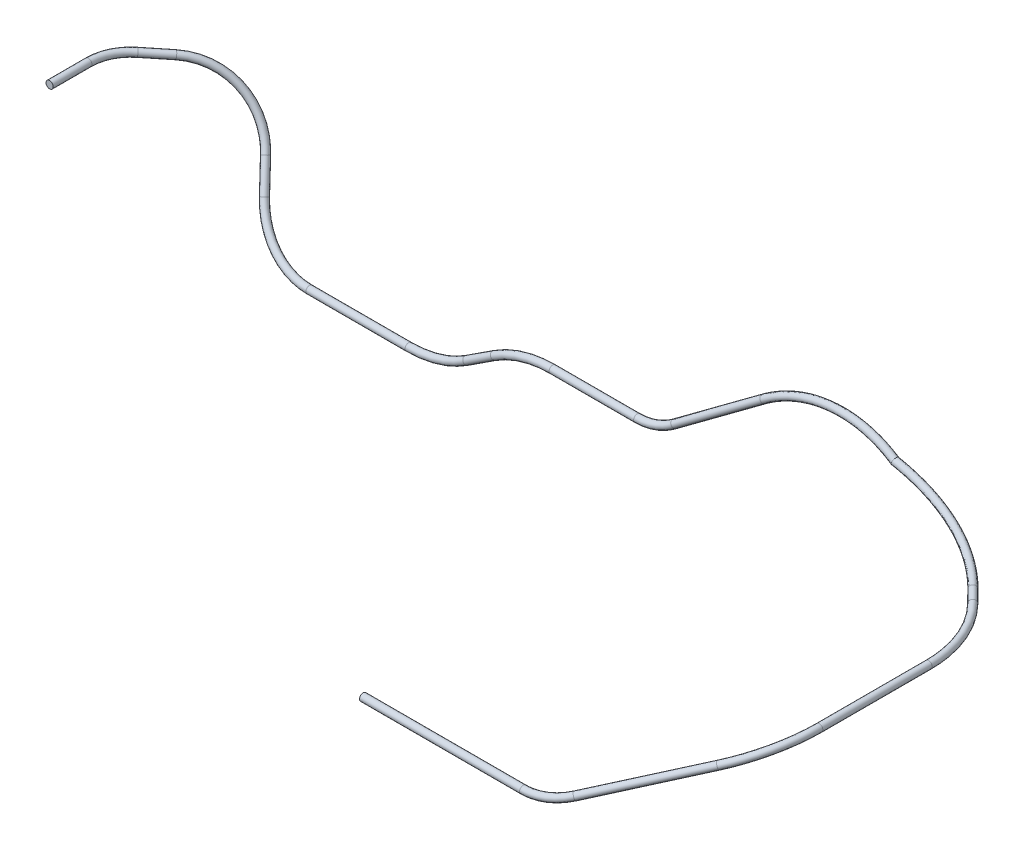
ISO-10303-21;
HEADER;
FILE_DESCRIPTION(('STEP AP214'),'2;1');
FILE_NAME('part.step','',(''),(''),'','','');
FILE_SCHEMA(('AUTOMOTIVE_DESIGN { 1 0 10303 214 1 1 1 1 }'));
ENDSEC;
DATA;
#1=APPLICATION_CONTEXT('core data for automotive mechanical design processes');
#2=APPLICATION_PROTOCOL_DEFINITION('international standard','automotive_design',2000,#1);
#3=PRODUCT_CONTEXT('',#1,'mechanical');
#4=PRODUCT('Part','Part','',(#3));
#5=PRODUCT_RELATED_PRODUCT_CATEGORY('part','',(#4));
#6=PRODUCT_DEFINITION_FORMATION('','',#4);
#7=PRODUCT_DEFINITION_CONTEXT('part definition',#1,'design');
#8=PRODUCT_DEFINITION('design','',#6,#7);
#9=PRODUCT_DEFINITION_SHAPE('','',#8);
#10=(LENGTH_UNIT() NAMED_UNIT(*) SI_UNIT(.MILLI.,.METRE.));
#11=(NAMED_UNIT(*) PLANE_ANGLE_UNIT() SI_UNIT($,.RADIAN.));
#12=(NAMED_UNIT(*) SI_UNIT($,.STERADIAN.) SOLID_ANGLE_UNIT());
#13=UNCERTAINTY_MEASURE_WITH_UNIT(LENGTH_MEASURE(1.E-05),#10,'distance_accuracy_value','');
#14=(GEOMETRIC_REPRESENTATION_CONTEXT(3) GLOBAL_UNCERTAINTY_ASSIGNED_CONTEXT((#13)) GLOBAL_UNIT_ASSIGNED_CONTEXT((#10,
#11,#12)) REPRESENTATION_CONTEXT('',''));
#15=CARTESIAN_POINT('',(0.,0.,0.));
#16=DIRECTION('',(0.,0.,1.));
#17=DIRECTION('',(1.,0.,0.));
#18=AXIS2_PLACEMENT_3D('',#15,#16,#17);
#19=CARTESIAN_POINT('',(0.,0.,0.));
#20=DIRECTION('',(0.,0.,1.));
#21=DIRECTION('',(1.,0.,0.));
#22=AXIS2_PLACEMENT_3D('',#19,#20,#21);
#23=PLANE('',#22);
#24=CARTESIAN_POINT('',(0.,0.,0.));
#25=DIRECTION('',(0.,0.,-1.));
#26=DIRECTION('',(-1.,0.,0.));
#27=AXIS2_PLACEMENT_3D('',#24,#25,#26);
#28=CIRCLE('',#27,0.7747);
#29=CARTESIAN_POINT('',(-0.7747,0.,0.));
#30=VERTEX_POINT('',#29);
#31=EDGE_CURVE('E24',#30,#30,#28,.T.);
#32=ORIENTED_EDGE('',*,*,#31,.F.);
#33=EDGE_LOOP('',(#32));
#34=FACE_BOUND('',#33,.T.);
#35=ADVANCED_FACE('F17',(#34),#23,.T.);
#36=CARTESIAN_POINT('',(0.,0.,0.));
#37=DIRECTION('',(0.,0.,-1.));
#38=DIRECTION('',(-1.,0.,0.));
#39=AXIS2_PLACEMENT_3D('',#36,#37,#38);
#40=CYLINDRICAL_SURFACE('',#39,0.7747);
#41=ORIENTED_EDGE('',*,*,#31,.T.);
#42=EDGE_LOOP('',(#41));
#43=FACE_BOUND('',#42,.T.);
#44=CARTESIAN_POINT('',(0.,0.,-8.31290035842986));
#45=DIRECTION('',(0.,0.,-1.));
#46=DIRECTION('',(-0.960776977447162,0.277322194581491,0.));
#47=AXIS2_PLACEMENT_3D('',#44,#45,#46);
#48=CIRCLE('',#47,0.7747);
#49=CARTESIAN_POINT('',(-0.744313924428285,0.214841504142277,-8.31290035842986));
#50=VERTEX_POINT('',#49);
#51=EDGE_CURVE('E194',#50,#50,#48,.T.);
#52=ORIENTED_EDGE('',*,*,#51,.F.);
#53=EDGE_LOOP('',(#52));
#54=FACE_BOUND('',#53,.T.);
#55=ADVANCED_FACE('F203',(#43,#54),#40,.T.);
#56=CARTESIAN_POINT('',(12.201867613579,-3.52199187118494,-8.31290035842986));
#57=DIRECTION('',(-0.277322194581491,-0.960776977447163,0.));
#58=DIRECTION('',(0.960776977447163,-0.277322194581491,0.));
#59=AXIS2_PLACEMENT_3D('',#56,#57,#58);
#60=TOROIDAL_SURFACE('',#59,12.7,0.7747);
#61=ORIENTED_EDGE('',*,*,#51,.T.);
#62=EDGE_LOOP('',(#61));
#63=FACE_BOUND('',#62,.T.);
#64=CARTESIAN_POINT('',(2.60163243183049,-0.750944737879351,-16.1517001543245));
#65=DIRECTION('',(0.593018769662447,-0.17117111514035,-0.786784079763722));
#66=DIRECTION('',(-0.79856992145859,0.,-0.601902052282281));
#67=AXIS2_PLACEMENT_3D('',#64,#65,#66);
#68=CIRCLE('',#67,0.7747);
#69=CARTESIAN_POINT('',(1.98298031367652,-0.750944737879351,-16.6179936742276));
#70=VERTEX_POINT('',#69);
#71=EDGE_CURVE('E189',#70,#70,#68,.T.);
#72=ORIENTED_EDGE('',*,*,#71,.F.);
#73=EDGE_LOOP('',(#72));
#74=FACE_BOUND('',#73,.T.);
#75=ADVANCED_FACE('F200',(#63,#74),#60,.T.);
#76=CARTESIAN_POINT('',(2.60163243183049,-0.750944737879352,-16.1517001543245));
#77=DIRECTION('',(0.593018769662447,-0.17117111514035,-0.786784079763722));
#78=DIRECTION('',(-0.79856992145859,0.,-0.601902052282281));
#79=AXIS2_PLACEMENT_3D('',#76,#77,#78);
#80=CYLINDRICAL_SURFACE('',#79,0.7747);
#81=ORIENTED_EDGE('',*,*,#71,.T.);
#82=EDGE_LOOP('',(#81));
#83=FACE_BOUND('',#82,.T.);
#84=CARTESIAN_POINT('',(6.16041103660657,-1.77816366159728,-20.8732882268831));
#85=DIRECTION('',(0.593018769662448,-0.171171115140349,-0.786784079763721));
#86=DIRECTION('',(-0.319919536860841,0.846614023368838,-0.425318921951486));
#87=AXIS2_PLACEMENT_3D('',#84,#85,#86);
#88=CIRCLE('',#87,0.7747);
#89=CARTESIAN_POINT('',(5.91256937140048,-1.12229177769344,-21.2027827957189));
#90=VERTEX_POINT('',#89);
#91=EDGE_CURVE('E185',#90,#90,#88,.T.);
#92=ORIENTED_EDGE('',*,*,#91,.F.);
#93=EDGE_LOOP('',(#92));
#94=FACE_BOUND('',#93,.T.);
#95=ADVANCED_FACE('F177',(#83,#94),#80,.T.);
#96=CARTESIAN_POINT('',(10.9889545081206,-14.5561035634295,-14.4539525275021));
#97=DIRECTION('',(-0.738904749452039,-0.503929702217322,-0.447297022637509));
#98=DIRECTION('',(0.673809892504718,-0.552612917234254,-0.490509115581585));
#99=AXIS2_PLACEMENT_3D('',#96,#97,#98);
#100=TOROIDAL_SURFACE('',#99,15.09299344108,0.7747);
#101=ORIENTED_EDGE('',*,*,#91,.T.);
#102=EDGE_LOOP('',(#101));
#103=FACE_BOUND('',#102,.T.);
#104=CARTESIAN_POINT('',(19.6885829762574,-16.5019183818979,-26.6329804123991));
#105=DIRECTION('',(0.34897098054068,-0.854069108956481,0.385726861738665));
#106=DIRECTION('',(0.,-0.411602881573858,-0.911363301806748));
#107=AXIS2_PLACEMENT_3D('',#104,#105,#106);
#108=CIRCLE('',#107,0.7747);
#109=CARTESIAN_POINT('',(19.6885829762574,-16.8207871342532,-27.3390135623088));
#110=VERTEX_POINT('',#109);
#111=EDGE_CURVE('E188',#110,#110,#108,.T.);
#112=ORIENTED_EDGE('',*,*,#111,.F.);
#113=EDGE_LOOP('',(#112));
#114=FACE_BOUND('',#113,.T.);
#115=ADVANCED_FACE('F172',(#103,#114),#100,.T.);
#116=CARTESIAN_POINT('',(19.6885829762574,-16.5019183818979,-26.6329804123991));
#117=DIRECTION('',(0.34897098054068,-0.854069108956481,0.385726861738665));
#118=DIRECTION('',(0.,-0.411602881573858,-0.911363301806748));
#119=AXIS2_PLACEMENT_3D('',#116,#117,#118);
#120=CYLINDRICAL_SURFACE('',#119,0.7747);
#121=ORIENTED_EDGE('',*,*,#111,.T.);
#122=EDGE_LOOP('',(#121));
#123=FACE_BOUND('',#122,.T.);
#124=CARTESIAN_POINT('',(21.9045487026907,-21.9252572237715,-24.1836148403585));
#125=DIRECTION('',(0.348970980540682,-0.854069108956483,0.385726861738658));
#126=DIRECTION('',(-0.9371335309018,-0.318039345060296,0.143637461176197));
#127=AXIS2_PLACEMENT_3D('',#124,#125,#126);
#128=CIRCLE('',#127,0.7747);
#129=CARTESIAN_POINT('',(21.1785513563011,-22.1716423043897,-24.0723388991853));
#130=VERTEX_POINT('',#129);
#131=EDGE_CURVE('E159',#130,#130,#128,.T.);
#132=ORIENTED_EDGE('',*,*,#131,.F.);
#133=EDGE_LOOP('',(#132));
#134=FACE_BOUND('',#133,.T.);
#135=ADVANCED_FACE('F168',(#123,#134),#120,.T.);
#136=CARTESIAN_POINT('',(35.416452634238,-17.3396598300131,-26.2546276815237));
#137=DIRECTION('',(0.,0.41160288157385,0.911363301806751));
#138=DIRECTION('',(1.,0.,0.));
#139=AXIS2_PLACEMENT_3D('',#136,#137,#138);
#140=TOROIDAL_SURFACE('',#139,14.4183336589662,0.7747);
#141=ORIENTED_EDGE('',*,*,#131,.T.);
#142=EDGE_LOOP('',(#141));
#143=FACE_BOUND('',#142,.T.);
#144=CARTESIAN_POINT('',(35.416452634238,-30.48,-20.32));
#145=DIRECTION('',(1.,0.,0.));
#146=DIRECTION('',(0.,0.,-1.));
#147=AXIS2_PLACEMENT_3D('',#144,#145,#146);
#148=CIRCLE('',#147,0.7747);
#149=CARTESIAN_POINT('',(35.416452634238,-30.48,-21.0947));
#150=VERTEX_POINT('',#149);
#151=EDGE_CURVE('E154',#150,#150,#148,.T.);
#152=ORIENTED_EDGE('',*,*,#151,.F.);
#153=EDGE_LOOP('',(#152));
#154=FACE_BOUND('',#153,.T.);
#155=ADVANCED_FACE('F165',(#143,#154),#140,.T.);
#156=CARTESIAN_POINT('',(35.416452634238,-30.48,-20.32));
#157=DIRECTION('',(1.,0.,0.));
#158=DIRECTION('',(0.,0.,-1.));
#159=AXIS2_PLACEMENT_3D('',#156,#157,#158);
#160=CYLINDRICAL_SURFACE('',#159,0.7747);
#161=ORIENTED_EDGE('',*,*,#151,.T.);
#162=EDGE_LOOP('',(#161));
#163=FACE_BOUND('',#162,.T.);
#164=CARTESIAN_POINT('',(56.7021215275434,-30.48,-20.32));
#165=DIRECTION('',(1.,0.,0.));
#166=DIRECTION('',(0.,-1.,0.));
#167=AXIS2_PLACEMENT_3D('',#164,#165,#166);
#168=CIRCLE('',#167,0.7747);
#169=CARTESIAN_POINT('',(56.7021215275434,-31.2547,-20.32));
#170=VERTEX_POINT('',#169);
#171=EDGE_CURVE('E150',#170,#170,#168,.T.);
#172=ORIENTED_EDGE('',*,*,#171,.F.);
#173=EDGE_LOOP('',(#172));
#174=FACE_BOUND('',#173,.T.);
#175=ADVANCED_FACE('F142',(#163,#174),#160,.T.);
#176=CARTESIAN_POINT('',(56.7021215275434,-7.62,-20.32));
#177=DIRECTION('',(0.,0.,1.));
#178=DIRECTION('',(1.,0.,0.));
#179=AXIS2_PLACEMENT_3D('',#176,#177,#178);
#180=TOROIDAL_SURFACE('',#179,22.86,0.7747);
#181=ORIENTED_EDGE('',*,*,#171,.T.);
#182=EDGE_LOOP('',(#181));
#183=FACE_BOUND('',#182,.T.);
#184=CARTESIAN_POINT('',(69.1932972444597,-26.7654989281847,-20.32));
#185=DIRECTION('',(0.837510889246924,0.546420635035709,0.));
#186=DIRECTION('',(-0.546420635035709,0.837510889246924,0.));
#187=AXIS2_PLACEMENT_3D('',#184,#185,#186);
#188=CIRCLE('',#187,0.7747);
#189=CARTESIAN_POINT('',(68.7699851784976,-26.1166792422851,-20.32));
#190=VERTEX_POINT('',#189);
#191=EDGE_CURVE('E153',#190,#190,#188,.T.);
#192=ORIENTED_EDGE('',*,*,#191,.F.);
#193=EDGE_LOOP('',(#192));
#194=FACE_BOUND('',#193,.T.);
#195=ADVANCED_FACE('F137',(#183,#194),#180,.T.);
#196=CARTESIAN_POINT('',(69.1932972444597,-26.7654989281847,-20.32));
#197=DIRECTION('',(0.837510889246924,0.546420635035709,0.));
#198=DIRECTION('',(-0.546420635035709,0.837510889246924,0.));
#199=AXIS2_PLACEMENT_3D('',#196,#197,#198);
#200=CYLINDRICAL_SURFACE('',#199,0.7747);
#201=ORIENTED_EDGE('',*,*,#191,.T.);
#202=EDGE_LOOP('',(#201));
#203=FACE_BOUND('',#202,.T.);
#204=CARTESIAN_POINT('',(75.111200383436,-22.9044573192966,-20.32));
#205=DIRECTION('',(0.837510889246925,0.546420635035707,0.));
#206=DIRECTION('',(-0.546420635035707,0.837510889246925,0.));
#207=AXIS2_PLACEMENT_3D('',#204,#205,#206);
#208=CIRCLE('',#207,0.7747);
#209=CARTESIAN_POINT('',(74.6878883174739,-22.255637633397,-20.32));
#210=VERTEX_POINT('',#209);
#211=EDGE_CURVE('E122',#210,#210,#208,.T.);
#212=ORIENTED_EDGE('',*,*,#211,.F.);
#213=EDGE_LOOP('',(#212));
#214=FACE_BOUND('',#213,.T.);
#215=ADVANCED_FACE('F133',(#203,#214),#200,.T.);
#216=CARTESIAN_POINT('',(87.6023761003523,-42.0499562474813,-20.32));
#217=DIRECTION('',(0.,0.,-1.));
#218=DIRECTION('',(1.,0.,0.));
#219=AXIS2_PLACEMENT_3D('',#216,#217,#218);
#220=TOROIDAL_SURFACE('',#219,22.86,0.7747);
#221=ORIENTED_EDGE('',*,*,#211,.T.);
#222=EDGE_LOOP('',(#221));
#223=FACE_BOUND('',#222,.T.);
#224=CARTESIAN_POINT('',(87.6024035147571,-19.1899562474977,-20.32));
#225=DIRECTION('',(0.999999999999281,-1.19923031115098E-06,0.));
#226=DIRECTION('',(1.19923031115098E-06,0.999999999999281,0.));
#227=AXIS2_PLACEMENT_3D('',#224,#225,#226);
#228=CIRCLE('',#227,0.7747);
#229=CARTESIAN_POINT('',(87.6024044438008,-18.4152562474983,-20.32));
#230=VERTEX_POINT('',#229);
#231=EDGE_CURVE('E117',#230,#230,#228,.T.);
#232=ORIENTED_EDGE('',*,*,#231,.F.);
#233=EDGE_LOOP('',(#232));
#234=FACE_BOUND('',#233,.T.);
#235=ADVANCED_FACE('F129',(#223,#234),#220,.T.);
#236=CARTESIAN_POINT('',(87.6024035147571,-19.1899562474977,-20.32));
#237=DIRECTION('',(0.999999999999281,-1.19923031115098E-06,0.));
#238=DIRECTION('',(1.19923031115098E-06,0.999999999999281,0.));
#239=AXIS2_PLACEMENT_3D('',#236,#237,#238);
#240=CYLINDRICAL_SURFACE('',#239,0.7747);
#241=ORIENTED_EDGE('',*,*,#231,.T.);
#242=EDGE_LOOP('',(#241));
#243=FACE_BOUND('',#242,.T.);
#244=CARTESIAN_POINT('',(105.738452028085,-19.1899779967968,-20.32));
#245=DIRECTION('',(0.999999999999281,-1.19923032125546E-06,0.));
#246=DIRECTION('',(-1.16382562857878E-06,-0.970477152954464,0.241193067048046));
#247=AXIS2_PLACEMENT_3D('',#244,#245,#246);
#248=CIRCLE('',#247,0.7747);
#249=CARTESIAN_POINT('',(105.738451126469,-19.9418066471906,-20.1331477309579));
#250=VERTEX_POINT('',#249);
#251=EDGE_CURVE('E113',#250,#250,#248,.T.);
#252=ORIENTED_EDGE('',*,*,#251,.F.);
#253=EDGE_LOOP('',(#252));
#254=FACE_BOUND('',#253,.T.);
#255=ADVANCED_FACE('F132',(#243,#254),#240,.T.);
#256=CARTESIAN_POINT('',(105.73846680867,-6.86491815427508,-23.3831519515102));
#257=DIRECTION('',(2.89246035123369E-07,0.241193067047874,0.970477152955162));
#258=DIRECTION('',(0.999999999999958,-6.97641383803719E-08,-2.80706668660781E-07));
#259=AXIS2_PLACEMENT_3D('',#256,#257,#258);
#260=TOROIDAL_SURFACE('',#259,12.7,0.7747);
#261=ORIENTED_EDGE('',*,*,#251,.T.);
#262=EDGE_LOOP('',(#261));
#263=FACE_BOUND('',#262,.T.);
#264=CARTESIAN_POINT('',(113.145659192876,-16.876532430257,-20.8949637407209));
#265=DIRECTION('',(0.812297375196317,0.566024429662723,-0.140674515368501));
#266=DIRECTION('',(-0.571709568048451,0.820456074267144,0.));
#267=AXIS2_PLACEMENT_3D('',#264,#265,#266);
#268=CIRCLE('',#267,0.7747);
#269=CARTESIAN_POINT('',(112.702755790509,-16.2409251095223,-20.8949637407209));
#270=VERTEX_POINT('',#269);
#271=EDGE_CURVE('E116',#270,#270,#268,.T.);
#272=ORIENTED_EDGE('',*,*,#271,.F.);
#273=EDGE_LOOP('',(#272));
#274=FACE_BOUND('',#273,.T.);
#275=ADVANCED_FACE('F96',(#263,#274),#260,.T.);
#276=CARTESIAN_POINT('',(113.145659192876,-16.8765324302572,-20.8949637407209));
#277=DIRECTION('',(0.812297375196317,0.566024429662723,-0.140674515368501));
#278=DIRECTION('',(-0.571709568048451,0.820456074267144,0.));
#279=AXIS2_PLACEMENT_3D('',#276,#277,#278);
#280=CYLINDRICAL_SURFACE('',#279,0.7747);
#281=ORIENTED_EDGE('',*,*,#271,.T.);
#282=EDGE_LOOP('',(#281));
#283=FACE_BOUND('',#282,.T.);
#284=CARTESIAN_POINT('',(129.167534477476,-5.02898316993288,-23.1850225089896));
#285=CARTESIAN_POINT('',(129.240266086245,-5.10627828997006,-23.0760562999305));
#286=CARTESIAN_POINT('',(129.416377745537,-5.32058706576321,-22.92143670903));
#287=CARTESIAN_POINT('',(129.683938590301,-5.71330377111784,-22.9566120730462));
#288=CARTESIAN_POINT('',(129.864653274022,-6.04487363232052,-23.2472303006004));
#289=CARTESIAN_POINT('',(129.897608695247,-6.20353498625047,-23.6953327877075));
#290=CARTESIAN_POINT('',(129.771696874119,-6.13580931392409,-24.1498817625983));
#291=CARTESIAN_POINT('',(129.529357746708,-5.86452428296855,-24.4576665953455));
#292=CARTESIAN_POINT('',(129.252274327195,-5.48111943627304,-24.514945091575));
#293=CARTESIAN_POINT('',(129.033840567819,-5.1148255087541,-24.3024109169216));
#294=CARTESIAN_POINT('',(128.947681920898,-4.88910581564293,-23.8917010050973));
#295=CARTESIAN_POINT('',(129.014556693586,-4.88118971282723,-23.473694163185));
#296=CARTESIAN_POINT('',(129.119046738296,-4.97745308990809,-23.2576666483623));
#297=CARTESIAN_POINT('',(129.167534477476,-5.02898316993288,-23.1850225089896));
#298=B_SPLINE_CURVE_WITH_KNOTS('',3,(#284,#285,#286,#287,#288,#289,#290,#291,#292,#293,#294,
#295,#296,#297),.UNSPECIFIED.,.T.,.F.,(4,1,1,1,1,1,1,1,1,1,1,4),(-6.28318530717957,
-5.69413668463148,-5.1050880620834,-4.51603943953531,-3.92699081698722,-3.33794219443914,
-2.74889357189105,-2.15984494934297,-1.57079632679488,-0.981747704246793,-0.392699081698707,0.),.UNSPECIFIED.);
#299=CARTESIAN_POINT('',(129.167534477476,-5.02898316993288,-23.1850225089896));
#300=VERTEX_POINT('',#299);
#301=EDGE_CURVE('E51',#300,#300,#298,.T.);
#302=ORIENTED_EDGE('',*,*,#301,.F.);
#303=EDGE_LOOP('',(#302));
#304=FACE_BOUND('',#303,.T.);
#305=ADVANCED_FACE('F92',(#283,#304),#280,.T.);
#306=CARTESIAN_POINT('',(129.167534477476,-5.02898316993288,-23.1850225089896));
#307=CARTESIAN_POINT('',(131.154339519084,-3.64468675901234,-23.5290699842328));
#308=CARTESIAN_POINT('',(135.534013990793,-1.43499651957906,-24.1190785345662));
#309=CARTESIAN_POINT('',(142.798712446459,-0.0621806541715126,-24.6391476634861));
#310=CARTESIAN_POINT('',(149.255629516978,-0.656287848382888,-24.738452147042));
#311=CARTESIAN_POINT('',(153.627386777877,-2.09346535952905,-24.5986557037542));
#312=CARTESIAN_POINT('',(155.562628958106,-3.00289612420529,-24.482112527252));
#313=CARTESIAN_POINT('',(156.377079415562,-3.42092330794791,-24.4260052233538));
#314=CARTESIAN_POINT('',(156.646036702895,-3.56688105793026,-24.4058940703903));
#315=CARTESIAN_POINT('',(156.908901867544,-3.71023904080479,-24.3860971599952));
#316=CARTESIAN_POINT('',(129.240266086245,-5.10627828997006,-23.0760562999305));
#317=CARTESIAN_POINT('',(131.217892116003,-3.72837730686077,-23.4185142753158));
#318=CARTESIAN_POINT('',(135.57733368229,-1.52889503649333,-24.0057971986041));
#319=CARTESIAN_POINT('',(142.808470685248,-0.162421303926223,-24.5234637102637));
#320=CARTESIAN_POINT('',(149.235558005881,-0.753783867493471,-24.6223094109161));
#321=CARTESIAN_POINT('',(153.587118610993,-2.18432194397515,-24.4831587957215));
#322=CARTESIAN_POINT('',(155.513420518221,-3.08955141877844,-24.3671540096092));
#323=CARTESIAN_POINT('',(156.324108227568,-3.50564732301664,-24.3113059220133));
#324=CARTESIAN_POINT('',(156.591626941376,-3.65082385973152,-24.2913024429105));
#325=CARTESIAN_POINT('',(156.854492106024,-3.79418184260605,-24.2715055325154));
#326=CARTESIAN_POINT('',(129.416377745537,-5.32058706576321,-22.92143670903));
#327=CARTESIAN_POINT('',(131.371288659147,-3.95851272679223,-23.2599612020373));
#328=CARTESIAN_POINT('',(135.68065578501,-1.78429496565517,-23.8404982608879));
#329=CARTESIAN_POINT('',(142.828733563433,-0.433517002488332,-24.3522186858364));
#330=CARTESIAN_POINT('',(149.181997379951,-1.01808694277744,-24.4499290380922));
#331=CARTESIAN_POINT('',(153.483574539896,-2.43219333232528,-24.3123767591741));
#332=CARTESIAN_POINT('',(155.387750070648,-3.32702489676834,-24.197704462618));
#333=CARTESIAN_POINT('',(156.18912617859,-3.73834150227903,-24.1424978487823));
#334=CARTESIAN_POINT('',(156.453084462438,-3.88158456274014,-24.1227608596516));
#335=CARTESIAN_POINT('',(156.715949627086,-4.02494254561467,-24.1029639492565));
#336=CARTESIAN_POINT('',(129.683938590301,-5.71330377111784,-22.9566120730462));
#337=CARTESIAN_POINT('',(131.60312518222,-4.37612017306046,-23.2889503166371));
#338=CARTESIAN_POINT('',(135.833742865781,-2.24163400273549,-23.8588786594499));
#339=CARTESIAN_POINT('',(142.851196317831,-0.915540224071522,-24.3612478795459));
#340=CARTESIAN_POINT('',(149.088360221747,-1.48942771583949,-24.4571726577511));
#341=CARTESIAN_POINT('',(153.311330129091,-2.87769267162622,-24.3221340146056));
#342=CARTESIAN_POINT('',(155.180708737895,-3.75617208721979,-24.2095572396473));
#343=CARTESIAN_POINT('',(155.967440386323,-4.15997223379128,-24.1553594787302));
#344=CARTESIAN_POINT('',(156.225799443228,-4.30017465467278,-24.1360415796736));
#345=CARTESIAN_POINT('',(156.488664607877,-4.44353263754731,-24.1162446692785));
#346=CARTESIAN_POINT('',(129.864653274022,-6.04487363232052,-23.2472303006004));
#347=CARTESIAN_POINT('',(131.758512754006,-4.72533657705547,-23.5751827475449));
#348=CARTESIAN_POINT('',(135.933299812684,-2.61901879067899,-24.1375898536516));
#349=CARTESIAN_POINT('',(142.858145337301,-1.31042520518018,-24.6333294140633));
#350=CARTESIAN_POINT('',(149.012998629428,-1.87673921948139,-24.7279882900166));
#351=CARTESIAN_POINT('',(153.180238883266,-3.2466835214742,-24.5947317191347));
#352=CARTESIAN_POINT('',(155.024947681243,-4.11356982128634,-24.4836406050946));
#353=CARTESIAN_POINT('',(155.801296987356,-4.51204109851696,-24.4301580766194));
#354=CARTESIAN_POINT('',(156.055686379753,-4.65008780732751,-24.4111372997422));
#355=CARTESIAN_POINT('',(156.318551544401,-4.79344579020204,-24.3913403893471));
#356=CARTESIAN_POINT('',(129.897608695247,-6.20353498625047,-23.6953327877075));
#357=CARTESIAN_POINT('',(131.78507502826,-4.88845231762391,-24.0221781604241));
#358=CARTESIAN_POINT('',(135.945769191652,-2.78924486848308,-24.5826867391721));
#359=CARTESIAN_POINT('',(142.847238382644,-1.48506872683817,-25.0767528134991));
#360=CARTESIAN_POINT('',(148.98131463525,-2.04947102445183,-25.1710921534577));
#361=CARTESIAN_POINT('',(153.134487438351,-3.41479077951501,-25.0382854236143));
#362=CARTESIAN_POINT('',(154.972969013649,-4.27875071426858,-24.9275693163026));
#363=CARTESIAN_POINT('',(155.746697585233,-4.67587686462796,-24.8742673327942));
#364=CARTESIAN_POINT('',(156.000084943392,-4.81337942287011,-24.85532155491));
#365=CARTESIAN_POINT('',(156.262950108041,-4.95673740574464,-24.835524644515));
#366=CARTESIAN_POINT('',(129.771696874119,-6.13580931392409,-24.1498817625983));
#367=CARTESIAN_POINT('',(131.673858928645,-4.81048747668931,-24.4792719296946));
#368=CARTESIAN_POINT('',(135.866948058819,-2.6949357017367,-25.0441446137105));
#369=CARTESIAN_POINT('',(142.822151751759,-1.38060530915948,-25.542057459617));
#370=CARTESIAN_POINT('',(149.003987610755,-1.94940201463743,-25.6371313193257));
#371=CARTESIAN_POINT('',(153.18949680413,-3.32535208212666,-25.5032905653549));
#372=CARTESIAN_POINT('',(155.042292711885,-4.1960387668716,-25.3917124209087));
#373=CARTESIAN_POINT('',(155.822045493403,-4.59625692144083,-25.3379954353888));
#374=CARTESIAN_POINT('',(156.077736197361,-4.73501030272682,-25.318877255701));
#375=CARTESIAN_POINT('',(156.340601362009,-4.87836828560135,-25.299080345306));
#376=CARTESIAN_POINT('',(129.529357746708,-5.86452428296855,-24.4576665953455));
#377=CARTESIAN_POINT('',(131.4623510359,-4.51772094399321,-24.7923956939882));
#378=CARTESIAN_POINT('',(135.723403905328,-2.36787921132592,-25.366424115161));
#379=CARTESIAN_POINT('',(142.791341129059,-1.03224547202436,-25.872407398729));
#380=CARTESIAN_POINT('',(149.073375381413,-1.61026152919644,-25.9690222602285));
#381=CARTESIAN_POINT('',(153.326725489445,-3.00851370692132,-25.8330121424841));
#382=CARTESIAN_POINT('',(155.209552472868,-3.8933129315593,-25.7196254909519));
#383=CARTESIAN_POINT('',(156.001943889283,-4.30001802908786,-25.6650378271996));
#384=CARTESIAN_POINT('',(156.262466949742,-4.44139560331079,-25.6455579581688));
#385=CARTESIAN_POINT('',(156.525332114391,-4.58475358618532,-25.6257610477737));
#386=CARTESIAN_POINT('',(129.252274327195,-5.48111943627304,-24.514945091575));
#387=CARTESIAN_POINT('',(131.221842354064,-4.10883283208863,-24.8560076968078));
#388=CARTESIAN_POINT('',(135.563519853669,-1.91831331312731,-25.440897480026));
#389=CARTESIAN_POINT('',(142.765191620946,-0.557407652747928,-25.9564546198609));
#390=CARTESIAN_POINT('',(149.166090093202,-1.1463605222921,-26.0548975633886));
#391=CARTESIAN_POINT('',(153.49991908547,-2.57106944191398,-25.9163139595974));
#392=CARTESIAN_POINT('',(155.418371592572,-3.47261021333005,-25.8007818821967));
#393=CARTESIAN_POINT('',(156.225756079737,-3.88701069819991,-25.7451613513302));
#394=CARTESIAN_POINT('',(156.492011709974,-4.03150132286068,-25.7252524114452));
#395=CARTESIAN_POINT('',(156.754876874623,-4.17485930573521,-25.7054555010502));
#396=CARTESIAN_POINT('',(129.033840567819,-5.1148255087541,-24.3024109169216));
#397=CARTESIAN_POINT('',(131.03339892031,-3.72164328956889,-24.6486668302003));
#398=CARTESIAN_POINT('',(135.441186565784,-1.49776903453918,-25.2424626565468));
#399=CARTESIAN_POINT('',(142.752517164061,-0.116141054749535,-25.7658701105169));
#400=CARTESIAN_POINT('',(149.250881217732,-0.714061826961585,-25.8658120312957));
#401=CARTESIAN_POINT('',(153.650700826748,-2.16046459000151,-25.7251182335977));
#402=CARTESIAN_POINT('',(155.598365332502,-3.07573299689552,-25.6078269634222));
#403=CARTESIAN_POINT('',(156.41804375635,-3.49644349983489,-25.5513595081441));
#404=CARTESIAN_POINT('',(156.688999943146,-3.64348674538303,-25.5310987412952));
#405=CARTESIAN_POINT('',(156.951865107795,-3.78684472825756,-25.5113018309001));
#406=CARTESIAN_POINT('',(128.947681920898,-4.88910581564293,-23.8917010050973));
#407=CARTESIAN_POINT('',(130.960537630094,-3.48665872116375,-24.240259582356));
#408=CARTESIAN_POINT('',(135.397637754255,-1.24799535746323,-24.838004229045));
#409=CARTESIAN_POINT('',(142.757589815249,0.142820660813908,-25.3648924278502));
#410=CARTESIAN_POINT('',(149.299169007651,-0.459076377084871,-25.4654989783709));
#411=CARTESIAN_POINT('',(153.728248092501,-1.91509794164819,-25.3238695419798));
#412=CARTESIAN_POINT('',(155.688864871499,-2.83645302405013,-25.2057982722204));
#413=CARTESIAN_POINT('',(156.513994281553,-3.25996131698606,-25.148955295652));
#414=CARTESIAN_POINT('',(156.78703464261,-3.40813636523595,-25.1285385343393));
#415=CARTESIAN_POINT('',(157.049899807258,-3.55149434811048,-25.1087416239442));
#416=CARTESIAN_POINT('',(129.014556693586,-4.88118971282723,-23.473694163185));
#417=CARTESIAN_POINT('',(131.020400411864,-3.48362820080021,-23.8210384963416));
#418=CARTESIAN_POINT('',(135.442042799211,-1.25276386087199,-24.4167007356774));
#419=CARTESIAN_POINT('',(142.776354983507,0.133206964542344,-24.9417534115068));
#420=CARTESIAN_POINT('',(149.295145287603,-0.466593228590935,-25.042009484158));
#421=CARTESIAN_POINT('',(153.708794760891,-1.91754242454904,-24.9008734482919));
#422=CARTESIAN_POINT('',(155.662581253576,-2.83568772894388,-24.7832135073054));
#423=CARTESIAN_POINT('',(156.484836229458,-3.25772068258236,-24.7265685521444));
#424=CARTESIAN_POINT('',(156.756777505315,-3.40529887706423,-24.7062340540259));
#425=CARTESIAN_POINT('',(157.019642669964,-3.54865685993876,-24.6864371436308));
#426=CARTESIAN_POINT('',(129.119046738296,-4.97745308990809,-23.2576666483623));
#427=CARTESIAN_POINT('',(131.111970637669,-3.58889339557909,-23.6027737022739));
#428=CARTESIAN_POINT('',(135.505134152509,-1.37239735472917,-24.1945994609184));
#429=CARTESIAN_POINT('',(142.792206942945,0.00464660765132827,-24.7162703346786));
#430=CARTESIAN_POINT('',(149.269010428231,-0.591290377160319,-24.8158806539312));
#431=CARTESIAN_POINT('',(153.654232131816,-2.03289423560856,-24.6756536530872));
#432=CARTESIAN_POINT('',(155.595434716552,-2.94512599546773,-24.5587515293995));
#433=CARTESIAN_POINT('',(156.412393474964,-3.36444059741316,-24.5024714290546));
#434=CARTESIAN_POINT('',(156.682309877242,-3.51091919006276,-24.4822884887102));
#435=CARTESIAN_POINT('',(156.94517504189,-3.65427717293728,-24.4624915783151));
#436=CARTESIAN_POINT('',(129.167534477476,-5.02898316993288,-23.1850225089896));
#437=CARTESIAN_POINT('',(131.154339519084,-3.64468675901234,-23.5290699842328));
#438=CARTESIAN_POINT('',(135.534013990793,-1.43499651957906,-24.1190785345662));
#439=CARTESIAN_POINT('',(142.798712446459,-0.0621806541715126,-24.6391476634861));
#440=CARTESIAN_POINT('',(149.255629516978,-0.656287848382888,-24.738452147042));
#441=CARTESIAN_POINT('',(153.627386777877,-2.09346535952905,-24.5986557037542));
#442=CARTESIAN_POINT('',(155.562628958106,-3.00289612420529,-24.482112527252));
#443=CARTESIAN_POINT('',(156.377079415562,-3.42092330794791,-24.4260052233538));
#444=CARTESIAN_POINT('',(156.646036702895,-3.56688105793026,-24.4058940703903));
#445=CARTESIAN_POINT('',(156.908901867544,-3.71023904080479,-24.3860971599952));
#446=B_SPLINE_SURFACE_WITH_KNOTS('',3,3,((#306,#307,#308,#309,#310,#311,#312,#313,#314,#315),
(#316,#317,#318,#319,#320,#321,#322,#323,#324,#325),(#326,#327,#328,#329,#330,#331,#332,#333,
#334,#335),(#336,#337,#338,#339,#340,#341,#342,#343,#344,#345),(#346,#347,#348,#349,#350,#351,
#352,#353,#354,#355),(#356,#357,#358,#359,#360,#361,#362,#363,#364,#365),(#366,#367,#368,#369,
#370,#371,#372,#373,#374,#375),(#376,#377,#378,#379,#380,#381,#382,#383,#384,#385),(#386,#387,
#388,#389,#390,#391,#392,#393,#394,#395),(#396,#397,#398,#399,#400,#401,#402,#403,#404,#405),
(#406,#407,#408,#409,#410,#411,#412,#413,#414,#415),(#416,#417,#418,#419,#420,#421,#422,#423,
#424,#425),(#426,#427,#428,#429,#430,#431,#432,#433,#434,#435),(#436,#437,#438,#439,#440,#441,
#442,#443,#444,#445)),.UNSPECIFIED.,.T.,.F.,.F.,(4,1,1,1,1,1,1,1,1,1,1,4),(4,1,1,1,1,2,4),
(-6.28318530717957,-5.69413668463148,-5.1050880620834,-4.51603943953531,-3.92699081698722,
-3.33794219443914,-2.74889357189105,-2.15984494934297,-1.57079632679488,-0.981747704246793,
-0.392699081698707,0.),(0.,0.28352995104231,0.567059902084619,0.850589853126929,
1.02779607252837,1.09867856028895,1.13411980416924),.UNSPECIFIED.);
#447=CARTESIAN_POINT('',(156.618989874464,-3.55209224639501,-24.4076065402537));
#448=CARTESIAN_POINT('',(156.618968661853,-3.55214606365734,-24.4075396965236));
#449=CARTESIAN_POINT('',(156.618947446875,-3.55219989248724,-24.4074728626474));
#450=CARTESIAN_POINT('',(156.615570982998,-3.56076788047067,-24.3968387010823));
#451=CARTESIAN_POINT('',(156.612156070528,-3.56957102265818,-24.3865179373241));
#452=CARTESIAN_POINT('',(156.606609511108,-3.5837142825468,-24.3708092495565));
#453=CARTESIAN_POINT('',(156.604569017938,-3.5888871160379,-24.3652361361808));
#454=CARTESIAN_POINT('',(156.600283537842,-3.59977224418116,-24.3538625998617));
#455=CARTESIAN_POINT('',(156.598034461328,-3.60549643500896,-24.3480750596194));
#456=CARTESIAN_POINT('',(156.593320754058,-3.61751217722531,-24.3363168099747));
#457=CARTESIAN_POINT('',(156.590851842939,-3.62381589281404,-24.330360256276));
#458=CARTESIAN_POINT('',(156.58569494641,-3.63702045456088,-24.3183114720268));
#459=CARTESIAN_POINT('',(156.583003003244,-3.64393380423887,-24.3122346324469));
#460=CARTESIAN_POINT('',(156.577394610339,-3.65838557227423,-24.2999981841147));
#461=CARTESIAN_POINT('',(156.574474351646,-3.66593666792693,-24.2938552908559));
#462=CARTESIAN_POINT('',(156.568404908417,-3.6816904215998,-24.281544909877));
#463=CARTESIAN_POINT('',(156.565252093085,-3.68990582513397,-24.2753955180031));
#464=CARTESIAN_POINT('',(156.558713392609,-3.70701237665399,-24.2631361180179));
#465=CARTESIAN_POINT('',(156.555324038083,-3.71591620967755,-24.2570456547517));
#466=CARTESIAN_POINT('',(156.54830874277,-3.73442095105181,-24.2449742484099));
#467=CARTESIAN_POINT('',(156.544679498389,-3.74403435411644,-24.2390143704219));
#468=CARTESIAN_POINT('',(156.537181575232,-3.76397604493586,-24.2272808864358));
#469=CARTESIAN_POINT('',(156.533309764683,-3.77431649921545,-24.2215299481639));
#470=CARTESIAN_POINT('',(156.52532467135,-3.79572588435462,-24.2102980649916));
#471=CARTESIAN_POINT('',(156.521208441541,-3.80680650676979,-24.2048414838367));
#472=CARTESIAN_POINT('',(156.512733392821,-3.82970497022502,-24.1942897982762));
#473=CARTESIAN_POINT('',(156.508371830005,-3.84153387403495,-24.189220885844));
#474=CARTESIAN_POINT('',(156.499406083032,-3.86593172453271,-24.1795429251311));
#475=CARTESIAN_POINT('',(156.494799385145,-3.87851092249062,-24.1749620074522));
#476=CARTESIAN_POINT('',(156.485344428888,-3.90440679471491,-24.1663710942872));
#477=CARTESIAN_POINT('',(156.48049391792,-3.91773275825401,-24.1623915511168));
#478=CARTESIAN_POINT('',(156.470554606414,-3.94510644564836,-24.155103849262));
#479=CARTESIAN_POINT('',(156.465463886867,-3.95916205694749,-24.1518279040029));
#480=CARTESIAN_POINT('',(156.460353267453,-3.97329900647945,-24.1489946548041));
#481=B_SPLINE_CURVE_WITH_KNOTS('',3,(#447,#448,#449,#450,#451,#452,#453,#454,#455,#456,#457,
#458,#459,#460,#461,#462,#463,#464,#465,#466,#467,#468,#469,#470,#471,#472,#473,#474,#475,#476,
#477,#478,#479,#480),.UNSPECIFIED.,.F.,.F.,(4,2,2,2,2,2,2,2,2,2,2,2,2,2,2,2,4),(0.,
0.000265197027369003,0.0422026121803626,0.0658183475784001,0.091149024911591,0.118195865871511,
0.146959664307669,0.177440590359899,0.209638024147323,0.243550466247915,0.279175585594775,
0.316510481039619,0.3555522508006,0.396298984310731,0.438751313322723,0.482914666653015,
0.528799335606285),.UNSPECIFIED.);
#482=CARTESIAN_POINT('',(156.618938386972,-3.55227175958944,-24.4078472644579));
#483=VERTEX_POINT('',#482);
#484=CARTESIAN_POINT('',(156.460349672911,-3.97332383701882,-24.149124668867));
#485=VERTEX_POINT('',#484);
#486=EDGE_CURVE('E45',#483,#485,#481,.T.);
#487=CARTESIAN_POINT('',(156.415403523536,-4.26568507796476,-25.6694571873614));
#488=CARTESIAN_POINT('',(156.418315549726,-4.2576707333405,-25.6710793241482));
#489=CARTESIAN_POINT('',(156.421228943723,-4.24962910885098,-25.6725642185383));
#490=CARTESIAN_POINT('',(156.426997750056,-4.23366261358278,-25.6752306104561));
#491=CARTESIAN_POINT('',(156.429853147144,-4.22573865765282,-25.6764176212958));
#492=CARTESIAN_POINT('',(156.435503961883,-4.21001867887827,-25.6785030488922));
#493=CARTESIAN_POINT('',(156.438299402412,-4.20222338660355,-25.6794069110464));
#494=CARTESIAN_POINT('',(156.443828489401,-4.18677085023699,-25.6809406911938));
#495=CARTESIAN_POINT('',(156.446562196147,-4.1791141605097,-25.6815759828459));
#496=CARTESIAN_POINT('',(156.45196624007,-4.16394778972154,-25.6825871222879));
#497=CARTESIAN_POINT('',(156.454636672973,-4.15643849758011,-25.6829682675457));
#498=CARTESIAN_POINT('',(156.459912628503,-4.14157530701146,-25.6834854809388));
#499=CARTESIAN_POINT('',(156.462518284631,-4.13422163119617,-25.6836267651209));
#500=CARTESIAN_POINT('',(156.470148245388,-4.1126525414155,-25.6837032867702));
#501=CARTESIAN_POINT('',(156.475162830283,-4.09843115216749,-25.6833236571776));
#502=CARTESIAN_POINT('',(156.484918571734,-4.07068550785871,-25.6817321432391));
#503=CARTESIAN_POINT('',(156.489661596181,-4.05715959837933,-25.6805597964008));
#504=CARTESIAN_POINT('',(156.498868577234,-4.03083906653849,-25.677490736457));
#505=CARTESIAN_POINT('',(156.503334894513,-4.01804084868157,-25.6756319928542));
#506=CARTESIAN_POINT('',(156.511985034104,-3.99319762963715,-25.6713157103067));
#507=CARTESIAN_POINT('',(156.516171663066,-3.98114745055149,-25.6688934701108));
#508=CARTESIAN_POINT('',(156.524261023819,-3.9578118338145,-25.6635677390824));
#509=CARTESIAN_POINT('',(156.528166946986,-3.94652001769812,-25.660696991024));
#510=CARTESIAN_POINT('',(156.535694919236,-3.92470493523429,-25.6545818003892));
#511=CARTESIAN_POINT('',(156.539320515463,-3.91417436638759,-25.6513677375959));
#512=CARTESIAN_POINT('',(156.54628877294,-3.89387870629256,-25.6446647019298));
#513=CARTESIAN_POINT('',(156.549635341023,-3.88410565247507,-25.6412038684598));
#514=CARTESIAN_POINT('',(156.556048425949,-3.86531649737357,-25.6340976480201));
#515=CARTESIAN_POINT('',(156.559119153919,-3.8562919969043,-25.6304782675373));
#516=CARTESIAN_POINT('',(156.564980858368,-3.83898624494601,-25.6231374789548));
#517=CARTESIAN_POINT('',(156.567776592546,-3.83069641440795,-25.6194400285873));
#518=CARTESIAN_POINT('',(156.574707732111,-3.81005876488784,-25.6097771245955));
#519=CARTESIAN_POINT('',(156.578802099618,-3.79778912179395,-25.6036138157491));
#520=CARTESIAN_POINT('',(156.586794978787,-3.77372779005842,-25.5906805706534));
#521=CARTESIAN_POINT('',(156.590695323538,-3.76193199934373,-25.5839193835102));
#522=CARTESIAN_POINT('',(156.598292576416,-3.73884202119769,-25.569830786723));
#523=CARTESIAN_POINT('',(156.601991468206,-3.72754330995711,-25.5625118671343));
#524=CARTESIAN_POINT('',(156.609182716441,-3.7054708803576,-25.5473471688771));
#525=CARTESIAN_POINT('',(156.612677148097,-3.69469221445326,-25.5395095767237));
#526=CARTESIAN_POINT('',(156.619455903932,-3.67367970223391,-25.5233459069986));
#527=CARTESIAN_POINT('',(156.622742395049,-3.6634405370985,-25.5150276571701));
#528=CARTESIAN_POINT('',(156.62910205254,-3.64352649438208,-25.4979377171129));
#529=CARTESIAN_POINT('',(156.63217746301,-3.63384595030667,-25.4891734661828));
#530=CARTESIAN_POINT('',(156.638114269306,-3.61505511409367,-25.4712391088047));
#531=CARTESIAN_POINT('',(156.640977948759,-3.60593899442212,-25.462075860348));
#532=CARTESIAN_POINT('',(156.646491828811,-3.58827704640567,-25.443393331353));
#533=CARTESIAN_POINT('',(156.649144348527,-3.57972527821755,-25.4338803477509));
#534=CARTESIAN_POINT('',(156.654236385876,-3.56319201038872,-25.4145443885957));
#535=CARTESIAN_POINT('',(156.656678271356,-3.55520442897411,-25.4047272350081));
#536=CARTESIAN_POINT('',(156.661349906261,-3.53979814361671,-25.3848268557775));
#537=CARTESIAN_POINT('',(156.663582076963,-3.53237320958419,-25.374749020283));
#538=CARTESIAN_POINT('',(156.667834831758,-3.51808971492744,-25.3543687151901));
#539=CARTESIAN_POINT('',(156.66985790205,-3.51122477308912,-25.3440712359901));
#540=CARTESIAN_POINT('',(156.673694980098,-3.49805811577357,-25.323290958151));
#541=CARTESIAN_POINT('',(156.675511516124,-3.4917498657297,-25.312812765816));
#542=CARTESIAN_POINT('',(156.679000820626,-3.47944716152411,-25.291281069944));
#543=CARTESIAN_POINT('',(156.680668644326,-3.47346507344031,-25.2802196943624));
#544=CARTESIAN_POINT('',(156.683805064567,-3.46199149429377,-25.2577636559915));
#545=CARTESIAN_POINT('',(156.685272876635,-3.45650196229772,-25.2463678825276));
#546=CARTESIAN_POINT('',(156.688006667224,-3.44603770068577,-25.2232656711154));
#547=CARTESIAN_POINT('',(156.689271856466,-3.44106500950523,-25.2115582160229));
#548=CARTESIAN_POINT('',(156.691595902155,-3.43165887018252,-25.187855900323));
#549=CARTESIAN_POINT('',(156.692653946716,-3.4272275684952,-25.175860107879));
#550=CARTESIAN_POINT('',(156.694559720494,-3.41892871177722,-25.1516051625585));
#551=CARTESIAN_POINT('',(156.695406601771,-3.41506345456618,-25.1393451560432));
#552=CARTESIAN_POINT('',(156.696885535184,-3.4079234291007,-25.1145862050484));
#553=CARTESIAN_POINT('',(156.697516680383,-3.40465118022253,-25.1020864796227));
#554=CARTESIAN_POINT('',(156.698562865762,-3.39870692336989,-25.0768782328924));
#555=CARTESIAN_POINT('',(156.698976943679,-3.39603761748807,-25.0641690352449));
#556=CARTESIAN_POINT('',(156.699588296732,-3.3913059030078,-25.0385731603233));
#557=CARTESIAN_POINT('',(156.699784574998,-3.38924631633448,-25.0256859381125));
#558=CARTESIAN_POINT('',(156.699959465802,-3.38574158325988,-24.9997659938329));
#559=CARTESIAN_POINT('',(156.699937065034,-3.38429932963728,-24.9867328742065));
#560=CARTESIAN_POINT('',(156.699673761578,-3.38203665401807,-24.9605540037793));
#561=CARTESIAN_POINT('',(156.699431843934,-3.38121915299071,-24.947408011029));
#562=CARTESIAN_POINT('',(156.698728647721,-3.38021348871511,-24.9210371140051));
#563=CARTESIAN_POINT('',(156.698266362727,-3.38002824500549,-24.9078121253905));
#564=CARTESIAN_POINT('',(156.697121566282,-3.38029462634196,-24.8813178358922));
#565=CARTESIAN_POINT('',(156.696438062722,-3.38074915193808,-24.8680486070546));
#566=CARTESIAN_POINT('',(156.694849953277,-3.38230264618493,-24.8415013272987));
#567=CARTESIAN_POINT('',(156.693944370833,-3.38340449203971,-24.8282235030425));
#568=CARTESIAN_POINT('',(156.691911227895,-3.38626018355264,-24.8016954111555));
#569=CARTESIAN_POINT('',(156.69078270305,-3.3880168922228,-24.788445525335));
#570=CARTESIAN_POINT('',(156.688302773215,-3.39218999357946,-24.7620106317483));
#571=CARTESIAN_POINT('',(156.686950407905,-3.39460925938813,-24.7488261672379));
#572=CARTESIAN_POINT('',(156.684021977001,-3.40011467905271,-24.7225602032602));
#573=CARTESIAN_POINT('',(156.682444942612,-3.40320375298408,-24.7094794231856));
#574=CARTESIAN_POINT('',(156.67906603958,-3.41005772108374,-24.6834603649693));
#575=CARTESIAN_POINT('',(156.67726317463,-3.41382564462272,-24.6705230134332));
#576=CARTESIAN_POINT('',(156.673432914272,-3.42203855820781,-24.644829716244));
#577=CARTESIAN_POINT('',(156.671404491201,-3.42648668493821,-24.6320749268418));
#578=CARTESIAN_POINT('',(156.667125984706,-3.43604677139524,-24.6067821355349));
#579=CARTESIAN_POINT('',(156.664874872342,-3.44116185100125,-24.5942454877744));
#580=CARTESIAN_POINT('',(156.660153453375,-3.45204472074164,-24.5694259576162));
#581=CARTESIAN_POINT('',(156.657682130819,-3.45781557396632,-24.5571446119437));
#582=CARTESIAN_POINT('',(156.652522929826,-3.46999778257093,-24.5328733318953));
#583=CARTESIAN_POINT('',(156.64983405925,-3.4764121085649,-24.5208850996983));
#584=CARTESIAN_POINT('',(156.644242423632,-3.48986879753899,-24.4972386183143));
#585=CARTESIAN_POINT('',(156.641338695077,-3.49691402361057,-24.4855822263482));
#586=CARTESIAN_POINT('',(156.635320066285,-3.51161956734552,-24.4626388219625));
#587=CARTESIAN_POINT('',(156.632204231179,-3.5192826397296,-24.4513538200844));
#588=CARTESIAN_POINT('',(156.625764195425,-3.53521038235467,-24.4291935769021));
#589=CARTESIAN_POINT('',(156.622439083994,-3.54347771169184,-24.4183205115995));
#590=CARTESIAN_POINT('',(156.619019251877,-3.55201885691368,-24.407697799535));
#591=B_SPLINE_CURVE_WITH_KNOTS('',3,(#487,#488,#489,#490,#491,#492,#493,#494,#495,#496,#497,
#498,#499,#500,#501,#502,#503,#504,#505,#506,#507,#508,#509,#510,#511,#512,#513,#514,#515,#516,
#517,#518,#519,#520,#521,#522,#523,#524,#525,#526,#527,#528,#529,#530,#531,#532,#533,#534,#535,
#536,#537,#538,#539,#540,#541,#542,#543,#544,#545,#546,#547,#548,#549,#550,#551,#552,#553,#554,
#555,#556,#557,#558,#559,#560,#561,#562,#563,#564,#565,#566,#567,#568,#569,#570,#571,#572,#573,
#574,#575,#576,#577,#578,#579,#580,#581,#582,#583,#584,#585,#586,#587,#588,#589,#590),
.UNSPECIFIED.,.F.,.F.,(4,2,2,2,2,2,2,2,2,2,2,2,2,2,2,2,2,2,2,2,2,2,2,2,2,2,2,2,2,2,2,2,2,2,2,2,
2,2,2,2,2,2,2,2,2,2,2,2,2,2,2,4),(0.,0.0260386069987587,0.0515522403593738,0.0765398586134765,
0.10100067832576,0.124934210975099,0.14834028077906,0.19356622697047,0.23668829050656,
0.277714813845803,0.316652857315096,0.353504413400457,0.388268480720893,0.420942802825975,
0.451524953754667,0.480012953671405,0.52297499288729,0.565388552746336,0.607251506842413,
0.648564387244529,0.689331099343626,0.729559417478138,0.769258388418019,0.808433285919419,
0.847086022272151,0.88521629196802,0.922822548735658,0.959902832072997,0.997943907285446,
1.03613013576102,1.07446167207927,1.11294056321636,1.15157156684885,1.19036303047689,
1.22932503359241,1.26846463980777,1.3077856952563,1.34728948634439,1.38697544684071,
1.42684191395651,1.46688693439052,1.50710912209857,1.54750856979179,1.58808781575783,
1.62885284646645,1.66981186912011,1.71096986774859,1.7523286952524,1.79388810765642,
1.83564673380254,1.87760310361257,1.91975673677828),.UNSPECIFIED.);
#592=CARTESIAN_POINT('',(156.415400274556,-4.26571065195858,-25.6695893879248));
#593=VERTEX_POINT('',#592);
#594=EDGE_CURVE('E39',#593,#483,#591,.T.);
#595=CARTESIAN_POINT('',(156.460353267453,-3.97329900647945,-24.1489946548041));
#596=CARTESIAN_POINT('',(156.457541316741,-3.98105797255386,-24.1474374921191));
#597=CARTESIAN_POINT('',(156.454728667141,-3.9888429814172,-24.1460118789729));
#598=CARTESIAN_POINT('',(156.449146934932,-4.00433689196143,-24.1434434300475));
#599=CARTESIAN_POINT('',(156.44637784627,-4.01204512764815,-24.1422965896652));
#600=CARTESIAN_POINT('',(156.440884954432,-4.02737547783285,-24.1402735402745));
#601=CARTESIAN_POINT('',(156.438161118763,-4.03499705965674,-24.1393933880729));
#602=CARTESIAN_POINT('',(156.432760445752,-4.0501445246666,-24.13789178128));
#603=CARTESIAN_POINT('',(156.430083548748,-4.05767000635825,-24.1372664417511));
#604=CARTESIAN_POINT('',(156.422190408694,-4.07990740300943,-24.1357731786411));
#605=CARTESIAN_POINT('',(156.416980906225,-4.09464569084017,-24.1352403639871));
#606=CARTESIAN_POINT('',(156.406766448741,-4.12364621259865,-24.1350860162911));
#607=CARTESIAN_POINT('',(156.401760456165,-4.13790796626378,-24.135434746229));
#608=CARTESIAN_POINT('',(156.391961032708,-4.1659071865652,-24.1369545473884));
#609=CARTESIAN_POINT('',(156.387166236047,-4.17964573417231,-24.1380967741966));
#610=CARTESIAN_POINT('',(156.377796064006,-4.20655852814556,-24.1411178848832));
#611=CARTESIAN_POINT('',(156.373218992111,-4.21973532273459,-24.1429688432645));
#612=CARTESIAN_POINT('',(156.364289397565,-4.24549401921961,-24.1473247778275));
#613=CARTESIAN_POINT('',(156.35993486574,-4.25807978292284,-24.1498027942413));
#614=CARTESIAN_POINT('',(156.351454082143,-4.28263389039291,-24.155333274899));
#615=CARTESIAN_POINT('',(156.347325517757,-4.29460727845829,-24.1583597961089));
#616=CARTESIAN_POINT('',(156.339299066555,-4.31792160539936,-24.1649107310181));
#617=CARTESIAN_POINT('',(156.335398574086,-4.32926863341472,-24.1684102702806));
#618=CARTESIAN_POINT('',(156.327829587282,-4.35132158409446,-24.1758337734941));
#619=CARTESIAN_POINT('',(156.324158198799,-4.36203451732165,-24.1797339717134));
#620=CARTESIAN_POINT('',(156.317046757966,-4.38282099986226,-24.1878745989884));
#621=CARTESIAN_POINT('',(156.313603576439,-4.39290213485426,-24.1920929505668));
#622=CARTESIAN_POINT('',(156.306947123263,-4.41243122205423,-24.2007922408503));
#623=CARTESIAN_POINT('',(156.303730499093,-4.42188718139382,-24.2052526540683));
#624=CARTESIAN_POINT('',(156.297525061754,-4.44017563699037,-24.2143646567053));
#625=CARTESIAN_POINT('',(156.294532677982,-4.44901643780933,-24.2189971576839));
#626=CARTESIAN_POINT('',(156.288773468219,-4.46608745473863,-24.2283877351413));
#627=CARTESIAN_POINT('',(156.286002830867,-4.47432615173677,-24.23312806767));
#628=CARTESIAN_POINT('',(156.280683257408,-4.49020815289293,-24.2426741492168));
#629=CARTESIAN_POINT('',(156.278130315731,-4.49786001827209,-24.2474634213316));
#630=CARTESIAN_POINT('',(156.273246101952,-4.51258650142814,-24.2570523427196));
#631=CARTESIAN_POINT('',(156.270910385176,-4.51966961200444,-24.2618367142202));
#632=CARTESIAN_POINT('',(156.265123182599,-4.53730750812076,-24.2741893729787));
#633=CARTESIAN_POINT('',(156.261718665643,-4.54776536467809,-24.2819189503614));
#634=CARTESIAN_POINT('',(156.255090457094,-4.56823043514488,-24.2978715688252));
#635=CARTESIAN_POINT('',(156.251865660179,-4.57824030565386,-24.3060907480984));
#636=CARTESIAN_POINT('',(156.245604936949,-4.59778999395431,-24.3229928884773));
#637=CARTESIAN_POINT('',(156.242567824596,-4.60733266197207,-24.331672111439));
#638=CARTESIAN_POINT('',(156.236684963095,-4.62592738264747,-24.3494647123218));
#639=CARTESIAN_POINT('',(156.233837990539,-4.63498248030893,-24.3585745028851));
#640=CARTESIAN_POINT('',(156.228339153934,-4.65258303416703,-24.377199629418));
#641=CARTESIAN_POINT('',(156.225686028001,-4.66113170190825,-24.3867115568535));
#642=CARTESIAN_POINT('',(156.220578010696,-4.67770150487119,-24.4061129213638));
#643=CARTESIAN_POINT('',(156.21812183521,-4.68572598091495,-24.4159991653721));
#644=CARTESIAN_POINT('',(156.213410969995,-4.70122953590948,-24.4361223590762));
#645=CARTESIAN_POINT('',(156.211154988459,-4.7087120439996,-24.4463563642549));
#646=CARTESIAN_POINT('',(156.206844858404,-4.72312895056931,-24.4671374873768));
#647=CARTESIAN_POINT('',(156.204789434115,-4.73006675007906,-24.4776819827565));
#648=CARTESIAN_POINT('',(156.200880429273,-4.74339327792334,-24.4990471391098));
#649=CARTESIAN_POINT('',(156.19902557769,-4.74978540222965,-24.5098654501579));
#650=CARTESIAN_POINT('',(156.195517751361,-4.7620196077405,-24.5317427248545));
#651=CARTESIAN_POINT('',(156.193863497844,-4.76786511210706,-24.542799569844));
#652=CARTESIAN_POINT('',(156.19075683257,-4.77900553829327,-24.5651195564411));
#653=CARTESIAN_POINT('',(156.189303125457,-4.78430393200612,-24.5763807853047));
#654=CARTESIAN_POINT('',(156.186597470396,-4.79434991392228,-24.5990763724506));
#655=CARTESIAN_POINT('',(156.185344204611,-4.79910103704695,-24.6105090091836));
#656=CARTESIAN_POINT('',(156.183039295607,-4.80805260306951,-24.6335153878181));
#657=CARTESIAN_POINT('',(156.181986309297,-4.81225664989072,-24.6450875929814));
#658=CARTESIAN_POINT('',(156.180081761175,-4.82011453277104,-24.6683422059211));
#659=CARTESIAN_POINT('',(156.179228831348,-4.82377203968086,-24.6800232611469));
#660=CARTESIAN_POINT('',(156.177724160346,-4.83053764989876,-24.7034657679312));
#661=CARTESIAN_POINT('',(156.177071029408,-4.83364948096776,-24.7152260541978));
#662=CARTESIAN_POINT('',(156.175965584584,-4.83932492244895,-24.7387982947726));
#663=CARTESIAN_POINT('',(156.175511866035,-4.84189229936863,-24.7506092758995));
#664=CARTESIAN_POINT('',(156.174804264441,-4.84648562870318,-24.7742829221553));
#665=CARTESIAN_POINT('',(156.174549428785,-4.84851413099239,-24.7861450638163));
#666=CARTESIAN_POINT('',(156.17423460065,-4.85204900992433,-24.8100402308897));
#667=CARTESIAN_POINT('',(156.174176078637,-4.85355137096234,-24.8220738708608));
#668=CARTESIAN_POINT('',(156.174258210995,-4.85600979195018,-24.8462886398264));
#669=CARTESIAN_POINT('',(156.174400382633,-4.85696161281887,-24.8584701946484));
#670=CARTESIAN_POINT('',(156.174886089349,-4.85830660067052,-24.8829549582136));
#671=CARTESIAN_POINT('',(156.175231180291,-4.85869536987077,-24.8952583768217));
#672=CARTESIAN_POINT('',(156.176123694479,-4.85890840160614,-24.9199596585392));
#673=CARTESIAN_POINT('',(156.17667268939,-4.85872819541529,-24.9323575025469));
#674=CARTESIAN_POINT('',(156.177974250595,-4.85779600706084,-24.9572192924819));
#675=CARTESIAN_POINT('',(156.178728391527,-4.85703951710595,-24.9696829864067));
#676=CARTESIAN_POINT('',(156.180441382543,-4.85494803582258,-24.994646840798));
#677=CARTESIAN_POINT('',(156.181401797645,-4.85360853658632,-25.007146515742));
#678=CARTESIAN_POINT('',(156.183528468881,-4.85034434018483,-25.0321514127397));
#679=CARTESIAN_POINT('',(156.184696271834,-4.84841516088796,-25.0446559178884));
#680=CARTESIAN_POINT('',(156.187238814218,-4.84396509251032,-25.0696382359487));
#681=CARTESIAN_POINT('',(156.188615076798,-4.84143976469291,-25.0821151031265));
#682=CARTESIAN_POINT('',(156.191575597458,-4.83579105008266,-25.1070085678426));
#683=CARTESIAN_POINT('',(156.193161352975,-4.83266327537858,-25.1194239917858));
#684=CARTESIAN_POINT('',(156.196541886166,-4.82580349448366,-25.1441596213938));
#685=CARTESIAN_POINT('',(156.198338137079,-4.82206714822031,-25.1564784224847));
#686=CARTESIAN_POINT('',(156.202140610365,-4.81398428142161,-25.1809845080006));
#687=CARTESIAN_POINT('',(156.204148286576,-4.80963345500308,-25.1931701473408));
#688=CARTESIAN_POINT('',(156.208374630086,-4.80031577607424,-25.2173720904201));
#689=CARTESIAN_POINT('',(156.210594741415,-4.79534462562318,-25.2293864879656));
#690=CARTESIAN_POINT('',(156.215246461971,-4.78478113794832,-25.2532071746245));
#691=CARTESIAN_POINT('',(156.217679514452,-4.7791844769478,-25.2650112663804));
#692=CARTESIAN_POINT('',(156.222759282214,-4.76736331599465,-25.2883694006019));
#693=CARTESIAN_POINT('',(156.2254074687,-4.76113440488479,-25.2999208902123));
#694=CARTESIAN_POINT('',(156.230911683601,-4.74805614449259,-25.3227400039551));
#695=CARTESIAN_POINT('',(156.233769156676,-4.74120238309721,-25.334004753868));
#696=CARTESIAN_POINT('',(156.238681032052,-4.72936110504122,-25.3523858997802));
#697=CARTESIAN_POINT('',(156.240680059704,-4.72452668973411,-25.3596163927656));
#698=CARTESIAN_POINT('',(156.244882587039,-4.71434374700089,-25.3743022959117));
#699=CARTESIAN_POINT('',(156.247091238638,-4.70898163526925,-25.3817468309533));
#700=CARTESIAN_POINT('',(156.251716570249,-4.6977092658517,-25.3968204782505));
#701=CARTESIAN_POINT('',(156.254138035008,-4.69178505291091,-25.4044376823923));
#702=CARTESIAN_POINT('',(156.259195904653,-4.67935573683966,-25.4198115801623));
#703=CARTESIAN_POINT('',(156.261836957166,-4.67283642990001,-25.4275552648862));
#704=CARTESIAN_POINT('',(156.267339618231,-4.65918504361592,-25.4431320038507));
#705=CARTESIAN_POINT('',(156.270205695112,-4.65203858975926,-25.4509508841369));
#706=CARTESIAN_POINT('',(156.276163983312,-4.63710254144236,-25.4666224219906));
#707=CARTESIAN_POINT('',(156.279260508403,-4.6292984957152,-25.4744596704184));
#708=CARTESIAN_POINT('',(156.285684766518,-4.61301877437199,-25.4901064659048));
#709=CARTESIAN_POINT('',(156.289016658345,-4.60452866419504,-25.4978992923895));
#710=CARTESIAN_POINT('',(156.29591624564,-4.58685066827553,-25.5133894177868));
#711=CARTESIAN_POINT('',(156.299487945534,-4.57764846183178,-25.5210685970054));
#712=CARTESIAN_POINT('',(156.306871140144,-4.55852296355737,-25.5362568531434));
#713=CARTESIAN_POINT('',(156.310686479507,-4.54858556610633,-25.5437463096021));
#714=CARTESIAN_POINT('',(156.318560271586,-4.52796959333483,-25.5584730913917));
#715=CARTESIAN_POINT('',(156.322622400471,-4.5172772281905,-25.565689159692));
#716=CARTESIAN_POINT('',(156.330992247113,-4.49513538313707,-25.5797801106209));
#717=CARTESIAN_POINT('',(156.33530345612,-4.48367255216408,-25.5866319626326));
#718=CARTESIAN_POINT('',(156.344173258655,-4.45997682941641,-25.599894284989));
#719=CARTESIAN_POINT('',(156.348735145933,-4.44773109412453,-25.6062796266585));
#720=CARTESIAN_POINT('',(156.35810504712,-4.42247254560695,-25.6185197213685));
#721=CARTESIAN_POINT('',(156.362916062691,-4.40944791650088,-25.6243477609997));
#722=CARTESIAN_POINT('',(156.372781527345,-4.38264405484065,-25.6353870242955));
#723=CARTESIAN_POINT('',(156.377838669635,-4.36885425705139,-25.6405702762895));
#724=CARTESIAN_POINT('',(156.385539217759,-4.34779545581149,-25.6477528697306));
#725=CARTESIAN_POINT('',(156.388157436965,-4.34062485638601,-25.6500725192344));
#726=CARTESIAN_POINT('',(156.393453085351,-4.32610296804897,-25.6545186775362));
#727=CARTESIAN_POINT('',(156.396130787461,-4.31875063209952,-25.6566414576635));
#728=CARTESIAN_POINT('',(156.401544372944,-4.30386993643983,-25.6606813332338));
#729=CARTESIAN_POINT('',(156.404280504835,-4.29634063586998,-25.6625946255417));
#730=CARTESIAN_POINT('',(156.409809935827,-4.28111097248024,-25.6662028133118));
#731=CARTESIAN_POINT('',(156.412603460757,-4.27340977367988,-25.6678938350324));
#732=CARTESIAN_POINT('',(156.415403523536,-4.26568507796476,-25.6694571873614));
#733=B_SPLINE_CURVE_WITH_KNOTS('',3,(#595,#596,#597,#598,#599,#600,#601,#602,#603,#604,#605,
#606,#607,#608,#609,#610,#611,#612,#613,#614,#615,#616,#617,#618,#619,#620,#621,#622,#623,#624,
#625,#626,#627,#628,#629,#630,#631,#632,#633,#634,#635,#636,#637,#638,#639,#640,#641,#642,#643,
#644,#645,#646,#647,#648,#649,#650,#651,#652,#653,#654,#655,#656,#657,#658,#659,#660,#661,#662,
#663,#664,#665,#666,#667,#668,#669,#670,#671,#672,#673,#674,#675,#676,#677,#678,#679,#680,#681,
#682,#683,#684,#685,#686,#687,#688,#689,#690,#691,#692,#693,#694,#695,#696,#697,#698,#699,#700,
#701,#702,#703,#704,#705,#706,#707,#708,#709,#710,#711,#712,#713,#714,#715,#716,#717,#718,#719,
#720,#721,#722,#723,#724,#725,#726,#727,#728,#729,#730,#731,#732),.UNSPECIFIED.,.F.,.F.,(4,2,2,
2,2,2,2,2,2,2,2,2,2,2,2,2,2,2,2,2,2,2,2,2,2,2,2,2,2,2,2,2,2,2,2,2,2,2,2,2,2,2,2,2,2,2,2,2,2,2,2,
2,2,2,2,2,2,2,2,2,2,2,2,2,2,2,2,2,4),(0.,0.0251940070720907,0.0500012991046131,
0.0744215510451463,0.0984541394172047,0.145348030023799,0.19068130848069,0.234447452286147,
0.276641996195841,0.317263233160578,0.356312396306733,0.393793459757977,0.429712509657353,
0.464074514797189,0.496881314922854,0.528132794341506,0.557827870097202,0.585965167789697,
0.61254345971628,0.652852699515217,0.692877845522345,0.732616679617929,0.772068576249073,
0.811235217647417,0.850121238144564,0.888734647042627,0.927083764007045,0.965173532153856,
1.00300606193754,1.04058147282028,1.07789866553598,1.11495602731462,1.15175207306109,
1.18828602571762,1.22455833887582,1.26065582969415,1.29702310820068,1.33366680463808,
1.37059519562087,1.40781434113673,1.44532764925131,1.48313631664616,1.52123983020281,
1.55963653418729,1.59832426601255,1.6373010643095,1.67656595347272,1.71611980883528,
1.75596630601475,1.79611291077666,1.83656895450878,1.86333783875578,1.89164160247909,
1.92148137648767,1.95285743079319,1.9857690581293,2.0202145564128,2.05619136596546,
2.09369642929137,2.13272685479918,2.17328098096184,2.21535995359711,2.25896988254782,
2.3041204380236,2.35081780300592,2.37474980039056,2.39906869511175,2.42377391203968,
2.44886463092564),.UNSPECIFIED.);
#734=EDGE_CURVE('E42',#485,#593,#733,.T.);
#735=ORIENTED_EDGE('',*,*,#486,.F.);
#736=ORIENTED_EDGE('',*,*,#594,.F.);
#737=ORIENTED_EDGE('',*,*,#734,.F.);
#738=EDGE_LOOP('',(#735,#736,#737));
#739=FACE_BOUND('',#738,.T.);
#740=ORIENTED_EDGE('',*,*,#301,.T.);
#741=EDGE_LOOP('',(#740));
#742=FACE_BOUND('',#741,.T.);
#743=ADVANCED_FACE('F47',(#739,#742),#446,.T.);
#744=CARTESIAN_POINT('',(156.294877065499,-3.49246657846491,-24.4098228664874));
#745=CARTESIAN_POINT('',(156.630506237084,-3.55448225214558,-24.4078192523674));
#746=CARTESIAN_POINT('',(157.290025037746,-3.67592058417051,-24.4015806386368));
#747=CARTESIAN_POINT('',(158.614019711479,-3.91274116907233,-24.3512162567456));
#748=CARTESIAN_POINT('',(160.928346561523,-4.31078801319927,-24.1767750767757));
#749=CARTESIAN_POINT('',(165.533429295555,-5.03832370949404,-23.4794174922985));
#750=CARTESIAN_POINT('',(171.944095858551,-5.86542205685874,-21.5003358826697));
#751=CARTESIAN_POINT('',(179.056567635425,-6.47791856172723,-17.6476628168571));
#752=CARTESIAN_POINT('',(183.219247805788,-6.61636487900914,-14.1981009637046));
#753=CARTESIAN_POINT('',(185.113792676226,-6.61673646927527,-12.2879899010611));
#754=CARTESIAN_POINT('',(156.276324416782,-3.58912660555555,-24.293845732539));
#755=CARTESIAN_POINT('',(156.611953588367,-3.65114227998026,-24.291842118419));
#756=CARTESIAN_POINT('',(157.269562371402,-3.77222871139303,-24.2856204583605));
#757=CARTESIAN_POINT('',(158.590469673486,-4.00849768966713,-24.2353769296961));
#758=CARTESIAN_POINT('',(160.89921393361,-4.40558436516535,-24.0613565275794));
#759=CARTESIAN_POINT('',(165.493188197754,-5.13136509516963,-23.3656810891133));
#760=CARTESIAN_POINT('',(171.888391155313,-5.95646833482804,-21.3913733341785));
#761=CARTESIAN_POINT('',(178.983706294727,-6.56748737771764,-17.5479936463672));
#762=CARTESIAN_POINT('',(183.13634504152,-6.70559975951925,-14.1067531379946));
#763=CARTESIAN_POINT('',(185.02632023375,-6.70597045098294,-12.201249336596));
#764=CARTESIAN_POINT('',(156.226823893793,-3.85146728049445,-24.1218635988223));
#765=CARTESIAN_POINT('',(156.562453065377,-3.91348295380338,-24.1198599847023));
#766=CARTESIAN_POINT('',(157.217655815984,-4.03412610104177,-24.113659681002));
#767=CARTESIAN_POINT('',(158.534674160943,-4.26970026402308,-24.0635683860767));
#768=CARTESIAN_POINT('',(160.836386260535,-4.66557746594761,-23.8900780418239));
#769=CARTESIAN_POINT('',(165.416368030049,-5.38914756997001,-23.1965215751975));
#770=CARTESIAN_POINT('',(171.792091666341,-6.21173762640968,-21.2282274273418));
#771=CARTESIAN_POINT('',(178.865795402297,-6.82089558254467,-17.3965542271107));
#772=CARTESIAN_POINT('',(183.005785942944,-6.95858725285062,-13.965794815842));
#773=CARTESIAN_POINT('',(184.890004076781,-6.95895681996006,-12.066095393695));
#774=CARTESIAN_POINT('',(156.140301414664,-4.3199807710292,-24.1297053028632));
#775=CARTESIAN_POINT('',(156.475930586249,-4.38199644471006,-24.1277016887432));
#776=CARTESIAN_POINT('',(157.132964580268,-4.50297697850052,-24.1214851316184));
#777=CARTESIAN_POINT('',(158.452942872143,-4.73907997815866,-24.0712779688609));
#778=CARTESIAN_POINT('',(160.760007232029,-5.1358777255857,-23.8973841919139));
#779=CARTESIAN_POINT('',(165.350638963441,-5.86113036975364,-23.2022149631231));
#780=CARTESIAN_POINT('',(171.741188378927,-6.68563323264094,-21.2293438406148));
#781=CARTESIAN_POINT('',(178.831340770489,-7.29620768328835,-17.3887606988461));
#782=CARTESIAN_POINT('',(182.980958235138,-7.43421954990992,-13.950023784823));
#783=CARTESIAN_POINT('',(184.86955790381,-7.43458997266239,-12.0459067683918));
#784=CARTESIAN_POINT('',(156.070679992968,-4.70553468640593,-24.4009180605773));
#785=CARTESIAN_POINT('',(156.406309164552,-4.76755036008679,-24.3989144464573));
#786=CARTESIAN_POINT('',(157.070001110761,-4.88975754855,-24.3926387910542));
#787=CARTESIAN_POINT('',(158.400741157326,-5.12778329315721,-24.3420103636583));
#788=CARTESIAN_POINT('',(160.72726510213,-5.52792794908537,-24.1666498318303));
#789=CARTESIAN_POINT('',(165.35661779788,-6.25929795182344,-23.4656169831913));
#790=CARTESIAN_POINT('',(171.801070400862,-7.09075532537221,-21.4761050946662));
#791=CARTESIAN_POINT('',(178.951026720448,-7.70647984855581,-17.6031274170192));
#792=CARTESIAN_POINT('',(183.135645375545,-7.84565581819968,-14.1353854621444));
#793=CARTESIAN_POINT('',(185.040174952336,-7.84602936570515,-12.2152076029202));
#794=CARTESIAN_POINT('',(156.041426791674,-4.87817107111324,-24.8440842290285));
#795=CARTESIAN_POINT('',(156.377055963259,-4.9401867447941,-24.8420806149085));
#796=CARTESIAN_POINT('',(157.04998838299,-5.06409638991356,-24.8357229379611));
#797=CARTESIAN_POINT('',(158.3956645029,-5.30479068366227,-24.7845098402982));
#798=CARTESIAN_POINT('',(160.749196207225,-5.70958046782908,-24.6071136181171));
#799=CARTESIAN_POINT('',(165.432289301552,-6.44944066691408,-23.8979427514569));
#800=CARTESIAN_POINT('',(171.95155294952,-7.2905501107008,-21.8853353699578));
#801=CARTESIAN_POINT('',(179.184510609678,-7.91342234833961,-17.9673977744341));
#802=CARTESIAN_POINT('',(183.417706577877,-8.05421395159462,-14.4594001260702));
#803=CARTESIAN_POINT('',(185.344345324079,-8.05459183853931,-12.5169316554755));
#804=CARTESIAN_POINT('',(156.062401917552,-4.77970097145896,-25.3098298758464));
#805=CARTESIAN_POINT('',(156.398031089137,-4.84171664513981,-25.3078262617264));
#806=CARTESIAN_POINT('',(157.079671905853,-4.96723071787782,-25.3013912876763));
#807=CARTESIAN_POINT('',(158.43942406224,-5.21043990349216,-25.2496271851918));
#808=CARTESIAN_POINT('',(160.818408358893,-5.61960734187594,-25.0703124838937));
#809=CARTESIAN_POINT('',(165.552147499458,-6.36746886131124,-24.3534721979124));
#810=CARTESIAN_POINT('',(172.141914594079,-7.21767460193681,-22.3190991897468));
#811=CARTESIAN_POINT('',(179.453093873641,-7.84728297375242,-18.3587905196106));
#812=CARTESIAN_POINT('',(183.732070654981,-7.98959719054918,-14.812855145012));
#813=CARTESIAN_POINT('',(185.679545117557,-7.98997916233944,-12.8493795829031));
#814=CARTESIAN_POINT('',(156.126535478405,-4.44331479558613,-25.6411704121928));
#815=CARTESIAN_POINT('',(156.46216464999,-4.50533046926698,-25.6391667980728));
#816=CARTESIAN_POINT('',(157.149046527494,-4.63181015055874,-25.6326853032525));
#817=CARTESIAN_POINT('',(158.517270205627,-4.87653289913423,-25.580589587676));
#818=CARTESIAN_POINT('',(160.911572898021,-5.28833498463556,-25.4001202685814));
#819=CARTESIAN_POINT('',(165.675792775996,-6.04101201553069,-24.6786642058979));
#820=CARTESIAN_POINT('',(172.307991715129,-6.89669226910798,-22.6311917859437));
#821=CARTESIAN_POINT('',(179.666248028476,-7.53035471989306,-18.6453825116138));
#822=CARTESIAN_POINT('',(183.972777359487,-7.67358530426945,-15.0766146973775));
#823=CARTESIAN_POINT('',(185.932791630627,-7.67396973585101,-13.1004962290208));
#824=CARTESIAN_POINT('',(156.21221056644,-3.98239512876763,-25.7264239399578));
#825=CARTESIAN_POINT('',(156.547839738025,-4.04441080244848,-25.7244203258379));
#826=CARTESIAN_POINT('',(157.234728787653,-4.17089180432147,-25.7179387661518));
#827=CARTESIAN_POINT('',(158.602964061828,-4.41561662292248,-25.6658425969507));
#828=CARTESIAN_POINT('',(160.997287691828,-4.82742231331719,-25.4853717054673));
#829=CARTESIAN_POINT('',(165.761549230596,-5.58010593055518,-24.7639093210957));
#830=CARTESIAN_POINT('',(172.393806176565,-6.43579367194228,-22.7164189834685));
#831=CARTESIAN_POINT('',(179.75212699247,-7.06946166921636,-18.7305748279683));
#832=CARTESIAN_POINT('',(184.058693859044,-7.21269350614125,-15.161775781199));
#833=CARTESIAN_POINT('',(186.018725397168,-7.21307794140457,-13.1856400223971));
#834=CARTESIAN_POINT('',(156.290549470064,-3.55229991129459,-25.5368548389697));
#835=CARTESIAN_POINT('',(156.626178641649,-3.61431558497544,-25.5348512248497));
#836=CARTESIAN_POINT('',(157.307838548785,-3.73983317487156,-25.5284160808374));
#837=CARTESIAN_POINT('',(158.667621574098,-3.98304787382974,-25.4766507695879));
#838=CARTESIAN_POINT('',(161.046661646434,-4.39222490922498,-25.2973318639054));
#839=CARTESIAN_POINT('',(165.780511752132,-5.14010396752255,-24.5804747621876));
#840=CARTESIAN_POINT('',(172.370433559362,-5.99032965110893,-22.5460540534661));
#841=CARTESIAN_POINT('',(179.68178414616,-6.61995278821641,-18.5856524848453));
#842=CARTESIAN_POINT('',(183.960861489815,-6.76227034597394,-15.0396339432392));
#843=CARTESIAN_POINT('',(185.908381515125,-6.76265232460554,-13.0761123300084));
#844=CARTESIAN_POINT('',(156.335147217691,-3.29799737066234,-25.1363594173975));
#845=CARTESIAN_POINT('',(156.670776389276,-3.36001304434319,-25.1343558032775));
#846=CARTESIAN_POINT('',(157.343733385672,-3.48392721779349,-25.1279979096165));
#847=CARTESIAN_POINT('',(158.689449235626,-3.72462860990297,-25.0767832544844));
#848=CARTESIAN_POINT('',(161.043052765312,-4.12943074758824,-24.8993816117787));
#849=CARTESIAN_POINT('',(165.726288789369,-4.86931352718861,-24.1901891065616));
#850=CARTESIAN_POINT('',(172.24575148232,-5.71044864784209,-22.1775203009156));
#851=CARTESIAN_POINT('',(179.478929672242,-6.33333989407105,-18.2594631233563));
#852=CARTESIAN_POINT('',(183.71225522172,-6.47413579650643,-14.7513583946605));
#853=CARTESIAN_POINT('',(185.638952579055,-6.47451369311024,-12.8088306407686));
#854=CARTESIAN_POINT('',(156.331406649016,-3.30456435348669,-24.7130303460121));
#855=CARTESIAN_POINT('',(156.667035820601,-3.36658002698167,-24.7110267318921));
#856=CARTESIAN_POINT('',(157.331780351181,-3.48898114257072,-24.7047417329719));
#857=CARTESIAN_POINT('',(158.664221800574,-3.72731086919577,-24.6540467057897));
#858=CARTESIAN_POINT('',(160.993822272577,-4.12798466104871,-24.4784542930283));
#859=CARTESIAN_POINT('',(165.629296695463,-4.86032179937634,-23.7764944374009));
#860=CARTESIAN_POINT('',(172.082270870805,-5.6928786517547,-21.7843517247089));
#861=CARTESIAN_POINT('',(179.241682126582,-6.30941738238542,-17.9062526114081));
#862=CARTESIAN_POINT('',(183.431834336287,-6.44877737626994,-14.4339248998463));
#863=CARTESIAN_POINT('',(185.338882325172,-6.44915142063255,-12.5112080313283));
#864=CARTESIAN_POINT('',(156.307245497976,-3.42802656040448,-24.4871409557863));
#865=CARTESIAN_POINT('',(156.642874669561,-3.49004223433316,-24.4851373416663));
#866=CARTESIAN_POINT('',(157.303666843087,-3.61171517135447,-24.4788874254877));
#867=CARTESIAN_POINT('',(158.629719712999,-3.84890348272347,-24.4284424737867));
#868=CARTESIAN_POINT('',(160.947768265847,-4.24759043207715,-24.2537207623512));
#869=CARTESIAN_POINT('',(165.560256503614,-4.97629608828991,-23.5552417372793));
#870=CARTESIAN_POINT('',(171.981232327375,-5.80472451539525,-21.5729774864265));
#871=CARTESIAN_POINT('',(179.105141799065,-6.41820598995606,-17.714108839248));
#872=CARTESIAN_POINT('',(183.274515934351,-6.5568749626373,-14.2589998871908));
#873=CARTESIAN_POINT('',(185.172107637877,-6.55724714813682,-12.3458169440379));
#874=CARTESIAN_POINT('',(156.294877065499,-3.49246657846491,-24.4098228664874));
#875=CARTESIAN_POINT('',(156.630506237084,-3.55448225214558,-24.4078192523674));
#876=CARTESIAN_POINT('',(157.290025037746,-3.67592058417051,-24.4015806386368));
#877=CARTESIAN_POINT('',(158.614019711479,-3.91274116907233,-24.3512162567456));
#878=CARTESIAN_POINT('',(160.928346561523,-4.31078801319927,-24.1767750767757));
#879=CARTESIAN_POINT('',(165.533429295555,-5.03832370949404,-23.4794174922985));
#880=CARTESIAN_POINT('',(171.944095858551,-5.86542205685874,-21.5003358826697));
#881=CARTESIAN_POINT('',(179.056567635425,-6.47791856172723,-17.6476628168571));
#882=CARTESIAN_POINT('',(183.219247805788,-6.61636487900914,-14.1981009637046));
#883=CARTESIAN_POINT('',(185.113792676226,-6.61673646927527,-12.2879899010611));
#884=B_SPLINE_SURFACE_WITH_KNOTS('',3,3,((#744,#745,#746,#747,#748,#749,#750,#751,#752,#753),
(#754,#755,#756,#757,#758,#759,#760,#761,#762,#763),(#764,#765,#766,#767,#768,#769,#770,#771,
#772,#773),(#774,#775,#776,#777,#778,#779,#780,#781,#782,#783),(#784,#785,#786,#787,#788,#789,
#790,#791,#792,#793),(#794,#795,#796,#797,#798,#799,#800,#801,#802,#803),(#804,#805,#806,#807,
#808,#809,#810,#811,#812,#813),(#814,#815,#816,#817,#818,#819,#820,#821,#822,#823),(#824,#825,
#826,#827,#828,#829,#830,#831,#832,#833),(#834,#835,#836,#837,#838,#839,#840,#841,#842,#843),
(#844,#845,#846,#847,#848,#849,#850,#851,#852,#853),(#854,#855,#856,#857,#858,#859,#860,#861,
#862,#863),(#864,#865,#866,#867,#868,#869,#870,#871,#872,#873),(#874,#875,#876,#877,#878,#879,
#880,#881,#882,#883)),.UNSPECIFIED.,.T.,.F.,.F.,(4,1,1,1,1,1,1,1,1,1,1,4),(4,1,1,1,1,1,1,4),
(-6.28318530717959,-5.6941366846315,-5.10508806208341,-4.51603943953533,-3.92699081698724,
-3.33794219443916,-2.74889357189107,-2.15984494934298,-1.5707963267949,-0.98174770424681,
-0.392699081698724,0.),(0.,0.102394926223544,0.204789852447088,0.409579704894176,
0.819159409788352,1.6383188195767,2.45747822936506,3.27663763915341),.UNSPECIFIED.);
#885=CARTESIAN_POINT('',(185.113792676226,-6.61673646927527,-12.2879899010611));
#886=CARTESIAN_POINT('',(185.172107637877,-6.55724714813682,-12.3458169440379));
#887=CARTESIAN_POINT('',(185.338882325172,-6.44915142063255,-12.5112080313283));
#888=CARTESIAN_POINT('',(185.638952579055,-6.47451369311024,-12.8088306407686));
#889=CARTESIAN_POINT('',(185.908381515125,-6.76265232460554,-13.0761123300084));
#890=CARTESIAN_POINT('',(186.018725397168,-7.21307794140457,-13.1856400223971));
#891=CARTESIAN_POINT('',(185.932791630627,-7.67396973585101,-13.1004962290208));
#892=CARTESIAN_POINT('',(185.679545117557,-7.98997916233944,-12.8493795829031));
#893=CARTESIAN_POINT('',(185.344345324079,-8.05459183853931,-12.5169316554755));
#894=CARTESIAN_POINT('',(185.040174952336,-7.84602936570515,-12.2152076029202));
#895=CARTESIAN_POINT('',(184.86955790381,-7.43458997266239,-12.0459067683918));
#896=CARTESIAN_POINT('',(184.890004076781,-6.95895681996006,-12.066095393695));
#897=CARTESIAN_POINT('',(185.02632023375,-6.70597045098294,-12.201249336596));
#898=CARTESIAN_POINT('',(185.113792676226,-6.61673646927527,-12.2879899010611));
#899=B_SPLINE_CURVE_WITH_KNOTS('',3,(#885,#886,#887,#888,#889,#890,#891,#892,#893,#894,#895,
#896,#897,#898),.UNSPECIFIED.,.T.,.F.,(4,1,1,1,1,1,1,1,1,1,1,4),(-6.28318530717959,
-5.89048622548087,-5.30143760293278,-4.71238898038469,-4.12334035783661,-3.53429173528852,
-2.94524311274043,-2.35619449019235,-1.76714586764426,-1.17809724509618,-0.58904862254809,0.),.UNSPECIFIED.);
#900=CARTESIAN_POINT('',(185.113792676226,-6.61673646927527,-12.2879899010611));
#901=VERTEX_POINT('',#900);
#902=EDGE_CURVE('E57',#901,#901,#899,.F.);
#903=ORIENTED_EDGE('',*,*,#594,.T.);
#904=ORIENTED_EDGE('',*,*,#486,.T.);
#905=ORIENTED_EDGE('',*,*,#734,.T.);
#906=EDGE_LOOP('',(#903,#904,#905));
#907=FACE_BOUND('',#906,.T.);
#908=ORIENTED_EDGE('',*,*,#902,.F.);
#909=EDGE_LOOP('',(#908));
#910=FACE_BOUND('',#909,.T.);
#911=ADVANCED_FACE('F19',(#907,#910),#884,.T.);
#912=CARTESIAN_POINT('',(185.436404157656,-7.24412924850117,-12.6080839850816));
#913=DIRECTION('',(0.704199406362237,-0.000135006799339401,0.710002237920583));
#914=DIRECTION('',(0.710002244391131,0.,-0.704199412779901));
#915=AXIS2_PLACEMENT_3D('',#912,#913,#914);
#916=CYLINDRICAL_SURFACE('',#915,0.7747);
#917=ORIENTED_EDGE('',*,*,#902,.T.);
#918=EDGE_LOOP('',(#917));
#919=FACE_BOUND('',#918,.T.);
#920=CARTESIAN_POINT('',(188.12179837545,-7.24464408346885,-9.90056124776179));
#921=DIRECTION('',(0.704199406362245,-0.000135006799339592,0.710002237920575));
#922=DIRECTION('',(0.710002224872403,-0.000136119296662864,-0.704199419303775));
#923=AXIS2_PLACEMENT_3D('',#920,#921,#922);
#924=CIRCLE('',#923,0.7747);
#925=CARTESIAN_POINT('',(188.671837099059,-7.24474953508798,-10.4461045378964));
#926=VERTEX_POINT('',#925);
#927=EDGE_CURVE('E308',#926,#926,#924,.T.);
#928=ORIENTED_EDGE('',*,*,#927,.F.);
#929=EDGE_LOOP('',(#928));
#930=FACE_BOUND('',#929,.T.);
#931=ADVANCED_FACE('F79',(#919,#930),#916,.T.);
#932=CARTESIAN_POINT('',(171.891147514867,-7.24153239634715,6.19743747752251));
#933=DIRECTION('',(-0.00019171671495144,-0.99999998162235,0.));
#934=DIRECTION('',(0.99999998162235,-0.00019171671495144,0.));
#935=AXIS2_PLACEMENT_3D('',#932,#933,#934);
#936=TOROIDAL_SURFACE('',#935,22.86,0.7747);
#937=ORIENTED_EDGE('',*,*,#927,.T.);
#938=EDGE_LOOP('',(#937));
#939=FACE_BOUND('',#938,.T.);
#940=CARTESIAN_POINT('',(194.751147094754,-7.24591504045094,6.19743747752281));
#941=DIRECTION('',(0.,0.,1.));
#942=DIRECTION('',(1.,0.,0.));
#943=AXIS2_PLACEMENT_3D('',#940,#941,#942);
#944=CIRCLE('',#943,0.774700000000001);
#945=CARTESIAN_POINT('',(195.525847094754,-7.24591504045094,6.19743747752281));
#946=VERTEX_POINT('',#945);
#947=EDGE_CURVE('E305',#946,#946,#944,.T.);
#948=ORIENTED_EDGE('',*,*,#947,.F.);
#949=EDGE_LOOP('',(#948));
#950=FACE_BOUND('',#949,.T.);
#951=ADVANCED_FACE('F89',(#939,#950),#936,.T.);
#952=CARTESIAN_POINT('',(194.751147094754,-7.24591504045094,6.19743747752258));
#953=DIRECTION('',(0.,0.,1.));
#954=DIRECTION('',(1.,0.,0.));
#955=AXIS2_PLACEMENT_3D('',#952,#953,#954);
#956=CYLINDRICAL_SURFACE('',#955,0.774700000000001);
#957=ORIENTED_EDGE('',*,*,#947,.T.);
#958=EDGE_LOOP('',(#957));
#959=FACE_BOUND('',#958,.T.);
#960=CARTESIAN_POINT('',(194.751147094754,-7.24591504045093,29.6668662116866));
#961=DIRECTION('',(0.,0.,1.));
#962=DIRECTION('',(0.912611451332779,0.408828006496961,0.));
#963=AXIS2_PLACEMENT_3D('',#960,#961,#962);
#964=CIRCLE('',#963,0.774700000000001);
#965=CARTESIAN_POINT('',(195.458147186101,-6.92919598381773,29.6668662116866));
#966=VERTEX_POINT('',#965);
#967=EDGE_CURVE('E284',#966,#966,#964,.T.);
#968=ORIENTED_EDGE('',*,*,#967,.F.);
#969=EDGE_LOOP('',(#968));
#970=FACE_BOUND('',#969,.T.);
#971=ADVANCED_FACE('F294',(#959,#970),#956,.T.);
#972=CARTESIAN_POINT('',(178.524915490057,-14.5148769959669,29.6668662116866));
#973=DIRECTION('',(0.408828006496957,-0.912611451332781,0.));
#974=DIRECTION('',(0.912611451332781,0.408828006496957,0.));
#975=AXIS2_PLACEMENT_3D('',#972,#973,#974);
#976=TOROIDAL_SURFACE('',#975,17.7800000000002,0.774700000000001);
#977=ORIENTED_EDGE('',*,*,#967,.T.);
#978=EDGE_LOOP('',(#977));
#979=FACE_BOUND('',#978,.T.);
#980=CARTESIAN_POINT('',(187.744836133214,-10.3845740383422,44.2977260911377));
#981=DIRECTION('',(-0.750972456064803,-0.336417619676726,0.56821083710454));
#982=DIRECTION('',(0.603380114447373,0.,0.79745372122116));
#983=AXIS2_PLACEMENT_3D('',#980,#981,#982);
#984=CIRCLE('',#983,0.774700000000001);
#985=CARTESIAN_POINT('',(188.212274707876,-10.3845740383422,44.9155134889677));
#986=VERTEX_POINT('',#985);
#987=EDGE_CURVE('E279',#986,#986,#984,.T.);
#988=ORIENTED_EDGE('',*,*,#987,.F.);
#989=EDGE_LOOP('',(#988));
#990=FACE_BOUND('',#989,.T.);
#991=ADVANCED_FACE('F291',(#979,#990),#976,.T.);
#992=CARTESIAN_POINT('',(187.744836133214,-10.3845740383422,44.2977260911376));
#993=DIRECTION('',(-0.750972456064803,-0.336417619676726,0.56821083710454));
#994=DIRECTION('',(0.603380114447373,0.,0.79745372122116));
#995=AXIS2_PLACEMENT_3D('',#992,#993,#994);
#996=CYLINDRICAL_SURFACE('',#995,0.774700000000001);
#997=ORIENTED_EDGE('',*,*,#987,.T.);
#998=EDGE_LOOP('',(#997));
#999=FACE_BOUND('',#998,.T.);
#1000=CARTESIAN_POINT('',(170.238522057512,-18.2269821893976,57.5435879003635));
#1001=DIRECTION('',(-0.750972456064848,-0.336417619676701,0.568210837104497));
#1002=DIRECTION('',(0.660333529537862,-0.382595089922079,0.646204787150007));
#1003=AXIS2_PLACEMENT_3D('',#1000,#1001,#1002);
#1004=CIRCLE('',#1003,0.774700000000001);
#1005=CARTESIAN_POINT('',(170.750082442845,-18.5233786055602,58.0442027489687));
#1006=VERTEX_POINT('',#1005);
#1007=EDGE_CURVE('E276',#1006,#1006,#1004,.T.);
#1008=ORIENTED_EDGE('',*,*,#1007,.F.);
#1009=EDGE_LOOP('',(#1008));
#1010=FACE_BOUND('',#1009,.T.);
#1011=ADVANCED_FACE('F293',(#999,#1010),#996,.T.);
#1012=CARTESIAN_POINT('',(127.511486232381,-19.8382453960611,60.2650185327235));
#1013=DIRECTION('',(1.,2.00960557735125E-13,0.));
#1014=DIRECTION('',(-2.00960557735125E-13,1.,0.));
#1015=AXIS2_PLACEMENT_3D('',#1012,#1013,#1014);
#1016=PLANE('',#1015);
#1017=CARTESIAN_POINT('',(127.511486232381,-19.838245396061,60.2650185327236));
#1018=DIRECTION('',(-1.,-2.00960557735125E-13,0.));
#1019=DIRECTION('',(2.00960557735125E-13,-1.,0.));
#1020=AXIS2_PLACEMENT_3D('',#1017,#1018,#1019);
#1021=CIRCLE('',#1020,0.774700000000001);
#1022=CARTESIAN_POINT('',(127.511486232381,-20.612945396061,60.2650185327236));
#1023=VERTEX_POINT('',#1022);
#1024=EDGE_CURVE('E30',#1023,#1023,#1021,.F.);
#1025=ORIENTED_EDGE('',*,*,#1024,.F.);
#1026=EDGE_LOOP('',(#1025));
#1027=FACE_BOUND('',#1026,.T.);
#1028=ADVANCED_FACE('F265',(#1027),#1016,.F.);
#1029=CARTESIAN_POINT('',(161.852286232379,-13.3680245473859,49.3367871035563));
#1030=DIRECTION('',(0.,-0.860490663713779,-0.509466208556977));
#1031=DIRECTION('',(1.,0.,0.));
#1032=AXIS2_PLACEMENT_3D('',#1029,#1030,#1031);
#1033=TOROIDAL_SURFACE('',#1032,12.7000000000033,0.774700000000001);
#1034=ORIENTED_EDGE('',*,*,#1007,.T.);
#1035=EDGE_LOOP('',(#1034));
#1036=FACE_BOUND('',#1035,.T.);
#1037=CARTESIAN_POINT('',(161.852286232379,-19.8382453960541,60.2650185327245));
#1038=DIRECTION('',(-1.,-2.00960557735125E-13,0.));
#1039=DIRECTION('',(2.00960557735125E-13,-1.,0.));
#1040=AXIS2_PLACEMENT_3D('',#1037,#1038,#1039);
#1041=CIRCLE('',#1040,0.774700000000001);
#1042=CARTESIAN_POINT('',(161.852286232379,-20.6129453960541,60.2650185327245));
#1043=VERTEX_POINT('',#1042);
#1044=EDGE_CURVE('E11',#1043,#1043,#1041,.T.);
#1045=ORIENTED_EDGE('',*,*,#1044,.F.);
#1046=EDGE_LOOP('',(#1045));
#1047=FACE_BOUND('',#1046,.T.);
#1048=ADVANCED_FACE('F259',(#1036,#1047),#1033,.T.);
#1049=CARTESIAN_POINT('',(161.852286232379,-19.8382453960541,60.2650185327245));
#1050=DIRECTION('',(-1.,-2.00960557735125E-13,0.));
#1051=DIRECTION('',(2.00960557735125E-13,-1.,0.));
#1052=AXIS2_PLACEMENT_3D('',#1049,#1050,#1051);
#1053=CYLINDRICAL_SURFACE('',#1052,0.774700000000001);
#1054=ORIENTED_EDGE('',*,*,#1044,.T.);
#1055=EDGE_LOOP('',(#1054));
#1056=FACE_BOUND('',#1055,.T.);
#1057=ORIENTED_EDGE('',*,*,#1024,.T.);
#1058=EDGE_LOOP('',(#1057));
#1059=FACE_BOUND('',#1058,.T.);
#1060=ADVANCED_FACE('F257',(#1056,#1059),#1053,.T.);
#1061=CLOSED_SHELL('',(#35,#55,#75,#95,#115,#135,#155,#175,#195,#215,#235,#255,#275,#305,#743,
#911,#931,#951,#971,#991,#1011,#1028,#1048,#1060));
#1062=MANIFOLD_SOLID_BREP('B1',#1061);
#1063=ADVANCED_BREP_SHAPE_REPRESENTATION('',(#18,#1062),#14);
#1064=SHAPE_DEFINITION_REPRESENTATION(#9,#1063);
ENDSEC;
END-ISO-10303-21;
